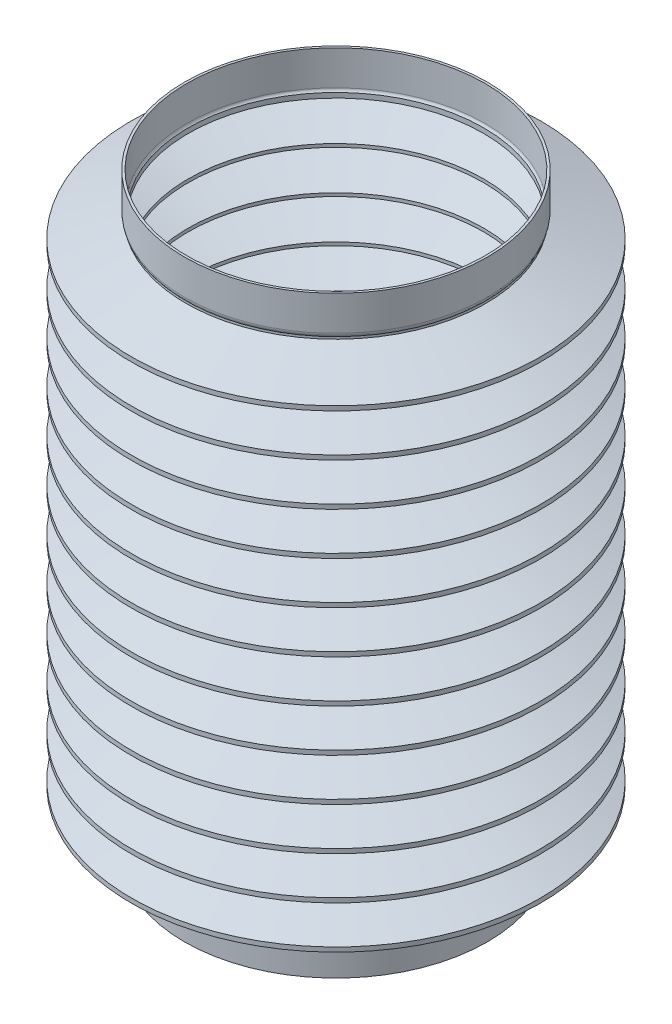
ISO-10303-21;
HEADER;
FILE_DESCRIPTION(('STEP AP214'),'2;1');
FILE_NAME('part.step','',(''),(''),'','','');
FILE_SCHEMA(('AUTOMOTIVE_DESIGN { 1 0 10303 214 1 1 1 1 }'));
ENDSEC;
DATA;
#1=APPLICATION_CONTEXT('core data for automotive mechanical design processes');
#2=APPLICATION_PROTOCOL_DEFINITION('international standard','automotive_design',2000,#1);
#3=PRODUCT_CONTEXT('',#1,'mechanical');
#4=PRODUCT('Part','Part','',(#3));
#5=PRODUCT_RELATED_PRODUCT_CATEGORY('part','',(#4));
#6=PRODUCT_DEFINITION_FORMATION('','',#4);
#7=PRODUCT_DEFINITION_CONTEXT('part definition',#1,'design');
#8=PRODUCT_DEFINITION('design','',#6,#7);
#9=PRODUCT_DEFINITION_SHAPE('','',#8);
#10=(LENGTH_UNIT() NAMED_UNIT(*) SI_UNIT(.MILLI.,.METRE.));
#11=(NAMED_UNIT(*) PLANE_ANGLE_UNIT() SI_UNIT($,.RADIAN.));
#12=(NAMED_UNIT(*) SI_UNIT($,.STERADIAN.) SOLID_ANGLE_UNIT());
#13=UNCERTAINTY_MEASURE_WITH_UNIT(LENGTH_MEASURE(1.E-05),#10,'distance_accuracy_value','');
#14=(GEOMETRIC_REPRESENTATION_CONTEXT(3) GLOBAL_UNCERTAINTY_ASSIGNED_CONTEXT((#13)) GLOBAL_UNIT_ASSIGNED_CONTEXT((#10,
#11,#12)) REPRESENTATION_CONTEXT('',''));
#15=CARTESIAN_POINT('',(0.,0.,0.));
#16=DIRECTION('',(0.,0.,1.));
#17=DIRECTION('',(1.,0.,0.));
#18=AXIS2_PLACEMENT_3D('',#15,#16,#17);
#19=CARTESIAN_POINT('',(0.,158.625,0.));
#20=DIRECTION('',(0.,-1.,0.));
#21=DIRECTION('',(0.,0.,-1.));
#22=AXIS2_PLACEMENT_3D('',#19,#20,#21);
#23=CONICAL_SURFACE('',#22,89.7549423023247,1.23449391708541);
#24=CARTESIAN_POINT('',(0.,167.278882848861,0.));
#25=DIRECTION('',(0.,-1.,0.));
#26=DIRECTION('',(0.,0.,-1.));
#27=AXIS2_PLACEMENT_3D('',#24,#25,#26);
#28=CIRCLE('',#27,65.);
#29=CARTESIAN_POINT('',(0.,167.278882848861,-65.));
#30=VERTEX_POINT('',#29);
#31=EDGE_CURVE('E292',#30,#30,#28,.T.);
#32=ORIENTED_EDGE('',*,*,#31,.F.);
#33=EDGE_LOOP('',(#32));
#34=FACE_BOUND('',#33,.T.);
#35=CARTESIAN_POINT('',(0.,158.625,0.));
#36=DIRECTION('',(0.,-1.,0.));
#37=DIRECTION('',(0.,0.,-1.));
#38=AXIS2_PLACEMENT_3D('',#35,#36,#37);
#39=CIRCLE('',#38,89.7549423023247);
#40=CARTESIAN_POINT('',(0.,158.625,-89.7549423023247));
#41=VERTEX_POINT('',#40);
#42=EDGE_CURVE('E10',#41,#41,#39,.T.);
#43=ORIENTED_EDGE('',*,*,#42,.T.);
#44=EDGE_LOOP('',(#43));
#45=FACE_BOUND('',#44,.T.);
#46=ADVANCED_FACE('F33',(#34,#45),#23,.F.);
#47=CARTESIAN_POINT('',(0.,149.971117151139,0.));
#48=DIRECTION('',(0.,1.,0.));
#49=DIRECTION('',(0.,0.,1.));
#50=AXIS2_PLACEMENT_3D('',#47,#48,#49);
#51=CONICAL_SURFACE('',#50,65.,1.23449391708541);
#52=ORIENTED_EDGE('',*,*,#42,.F.);
#53=EDGE_LOOP('',(#52));
#54=FACE_BOUND('',#53,.T.);
#55=CARTESIAN_POINT('',(0.,149.971117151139,0.));
#56=DIRECTION('',(0.,-1.,0.));
#57=DIRECTION('',(0.,0.,-1.));
#58=AXIS2_PLACEMENT_3D('',#55,#56,#57);
#59=CIRCLE('',#58,65.);
#60=CARTESIAN_POINT('',(0.,149.971117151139,-65.));
#61=VERTEX_POINT('',#60);
#62=EDGE_CURVE('E39',#61,#61,#59,.T.);
#63=ORIENTED_EDGE('',*,*,#62,.T.);
#64=EDGE_LOOP('',(#63));
#65=FACE_BOUND('',#64,.T.);
#66=ADVANCED_FACE('F299',(#54,#65),#51,.F.);
#67=CARTESIAN_POINT('',(0.,0.,0.));
#68=DIRECTION('',(0.,-1.,0.));
#69=DIRECTION('',(0.,0.,-1.));
#70=AXIS2_PLACEMENT_3D('',#67,#68,#69);
#71=CYLINDRICAL_SURFACE('',#70,65.);
#72=ORIENTED_EDGE('',*,*,#62,.F.);
#73=EDGE_LOOP('',(#72));
#74=FACE_BOUND('',#73,.T.);
#75=CARTESIAN_POINT('',(0.,148.528882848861,0.));
#76=DIRECTION('',(0.,-1.,0.));
#77=DIRECTION('',(0.,0.,-1.));
#78=AXIS2_PLACEMENT_3D('',#75,#76,#77);
#79=CIRCLE('',#78,65.);
#80=CARTESIAN_POINT('',(0.,148.528882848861,-65.));
#81=VERTEX_POINT('',#80);
#82=EDGE_CURVE('E43',#81,#81,#79,.T.);
#83=ORIENTED_EDGE('',*,*,#82,.T.);
#84=EDGE_LOOP('',(#83));
#85=FACE_BOUND('',#84,.T.);
#86=ADVANCED_FACE('F303',(#74,#85),#71,.F.);
#87=CARTESIAN_POINT('',(0.,139.875,0.));
#88=DIRECTION('',(0.,-1.,0.));
#89=DIRECTION('',(0.,0.,-1.));
#90=AXIS2_PLACEMENT_3D('',#87,#88,#89);
#91=CONICAL_SURFACE('',#90,89.7549423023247,1.23449391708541);
#92=ORIENTED_EDGE('',*,*,#82,.F.);
#93=EDGE_LOOP('',(#92));
#94=FACE_BOUND('',#93,.T.);
#95=CARTESIAN_POINT('',(0.,139.875,0.));
#96=DIRECTION('',(0.,-1.,0.));
#97=DIRECTION('',(0.,0.,-1.));
#98=AXIS2_PLACEMENT_3D('',#95,#96,#97);
#99=CIRCLE('',#98,89.7549423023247);
#100=CARTESIAN_POINT('',(0.,139.875,-89.7549423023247));
#101=VERTEX_POINT('',#100);
#102=EDGE_CURVE('E47',#101,#101,#99,.T.);
#103=ORIENTED_EDGE('',*,*,#102,.T.);
#104=EDGE_LOOP('',(#103));
#105=FACE_BOUND('',#104,.T.);
#106=ADVANCED_FACE('F308',(#94,#105),#91,.F.);
#107=CARTESIAN_POINT('',(0.,131.221117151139,0.));
#108=DIRECTION('',(0.,1.,0.));
#109=DIRECTION('',(0.,0.,1.));
#110=AXIS2_PLACEMENT_3D('',#107,#108,#109);
#111=CONICAL_SURFACE('',#110,65.,1.23449391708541);
#112=ORIENTED_EDGE('',*,*,#102,.F.);
#113=EDGE_LOOP('',(#112));
#114=FACE_BOUND('',#113,.T.);
#115=CARTESIAN_POINT('',(0.,131.221117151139,0.));
#116=DIRECTION('',(0.,-1.,0.));
#117=DIRECTION('',(0.,0.,-1.));
#118=AXIS2_PLACEMENT_3D('',#115,#116,#117);
#119=CIRCLE('',#118,65.);
#120=CARTESIAN_POINT('',(0.,131.221117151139,-65.));
#121=VERTEX_POINT('',#120);
#122=EDGE_CURVE('E52',#121,#121,#119,.T.);
#123=ORIENTED_EDGE('',*,*,#122,.T.);
#124=EDGE_LOOP('',(#123));
#125=FACE_BOUND('',#124,.T.);
#126=ADVANCED_FACE('F314',(#114,#125),#111,.F.);
#127=CARTESIAN_POINT('',(0.,0.,0.));
#128=DIRECTION('',(0.,-1.,0.));
#129=DIRECTION('',(0.,0.,-1.));
#130=AXIS2_PLACEMENT_3D('',#127,#128,#129);
#131=CYLINDRICAL_SURFACE('',#130,65.);
#132=ORIENTED_EDGE('',*,*,#122,.F.);
#133=EDGE_LOOP('',(#132));
#134=FACE_BOUND('',#133,.T.);
#135=CARTESIAN_POINT('',(0.,129.778882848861,0.));
#136=DIRECTION('',(0.,-1.,0.));
#137=DIRECTION('',(0.,0.,-1.));
#138=AXIS2_PLACEMENT_3D('',#135,#136,#137);
#139=CIRCLE('',#138,65.);
#140=CARTESIAN_POINT('',(0.,129.778882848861,-65.));
#141=VERTEX_POINT('',#140);
#142=EDGE_CURVE('E55',#141,#141,#139,.T.);
#143=ORIENTED_EDGE('',*,*,#142,.T.);
#144=EDGE_LOOP('',(#143));
#145=FACE_BOUND('',#144,.T.);
#146=ADVANCED_FACE('F318',(#134,#145),#131,.F.);
#147=CARTESIAN_POINT('',(0.,121.125,0.));
#148=DIRECTION('',(0.,-1.,0.));
#149=DIRECTION('',(0.,0.,-1.));
#150=AXIS2_PLACEMENT_3D('',#147,#148,#149);
#151=CONICAL_SURFACE('',#150,89.7549423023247,1.23449391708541);
#152=ORIENTED_EDGE('',*,*,#142,.F.);
#153=EDGE_LOOP('',(#152));
#154=FACE_BOUND('',#153,.T.);
#155=CARTESIAN_POINT('',(0.,121.125,0.));
#156=DIRECTION('',(0.,-1.,0.));
#157=DIRECTION('',(0.,0.,-1.));
#158=AXIS2_PLACEMENT_3D('',#155,#156,#157);
#159=CIRCLE('',#158,89.7549423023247);
#160=CARTESIAN_POINT('',(0.,121.125,-89.7549423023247));
#161=VERTEX_POINT('',#160);
#162=EDGE_CURVE('E58',#161,#161,#159,.T.);
#163=ORIENTED_EDGE('',*,*,#162,.T.);
#164=EDGE_LOOP('',(#163));
#165=FACE_BOUND('',#164,.T.);
#166=ADVANCED_FACE('F322',(#154,#165),#151,.F.);
#167=CARTESIAN_POINT('',(0.,112.471117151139,0.));
#168=DIRECTION('',(0.,1.,0.));
#169=DIRECTION('',(0.,0.,1.));
#170=AXIS2_PLACEMENT_3D('',#167,#168,#169);
#171=CONICAL_SURFACE('',#170,65.,1.23449391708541);
#172=ORIENTED_EDGE('',*,*,#162,.F.);
#173=EDGE_LOOP('',(#172));
#174=FACE_BOUND('',#173,.T.);
#175=CARTESIAN_POINT('',(0.,112.471117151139,0.));
#176=DIRECTION('',(0.,-1.,0.));
#177=DIRECTION('',(0.,0.,-1.));
#178=AXIS2_PLACEMENT_3D('',#175,#176,#177);
#179=CIRCLE('',#178,65.);
#180=CARTESIAN_POINT('',(0.,112.471117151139,-65.));
#181=VERTEX_POINT('',#180);
#182=EDGE_CURVE('E61',#181,#181,#179,.T.);
#183=ORIENTED_EDGE('',*,*,#182,.T.);
#184=EDGE_LOOP('',(#183));
#185=FACE_BOUND('',#184,.T.);
#186=ADVANCED_FACE('F326',(#174,#185),#171,.F.);
#187=CARTESIAN_POINT('',(0.,0.,0.));
#188=DIRECTION('',(0.,-1.,0.));
#189=DIRECTION('',(0.,0.,-1.));
#190=AXIS2_PLACEMENT_3D('',#187,#188,#189);
#191=CYLINDRICAL_SURFACE('',#190,65.);
#192=ORIENTED_EDGE('',*,*,#182,.F.);
#193=EDGE_LOOP('',(#192));
#194=FACE_BOUND('',#193,.T.);
#195=CARTESIAN_POINT('',(0.,111.028882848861,0.));
#196=DIRECTION('',(0.,-1.,0.));
#197=DIRECTION('',(0.,0.,-1.));
#198=AXIS2_PLACEMENT_3D('',#195,#196,#197);
#199=CIRCLE('',#198,65.);
#200=CARTESIAN_POINT('',(0.,111.028882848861,-65.));
#201=VERTEX_POINT('',#200);
#202=EDGE_CURVE('E64',#201,#201,#199,.T.);
#203=ORIENTED_EDGE('',*,*,#202,.T.);
#204=EDGE_LOOP('',(#203));
#205=FACE_BOUND('',#204,.T.);
#206=ADVANCED_FACE('F330',(#194,#205),#191,.F.);
#207=CARTESIAN_POINT('',(0.,102.375,0.));
#208=DIRECTION('',(0.,-1.,0.));
#209=DIRECTION('',(0.,0.,-1.));
#210=AXIS2_PLACEMENT_3D('',#207,#208,#209);
#211=CONICAL_SURFACE('',#210,89.7549423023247,1.23449391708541);
#212=ORIENTED_EDGE('',*,*,#202,.F.);
#213=EDGE_LOOP('',(#212));
#214=FACE_BOUND('',#213,.T.);
#215=CARTESIAN_POINT('',(0.,102.375,0.));
#216=DIRECTION('',(0.,-1.,0.));
#217=DIRECTION('',(0.,0.,-1.));
#218=AXIS2_PLACEMENT_3D('',#215,#216,#217);
#219=CIRCLE('',#218,89.7549423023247);
#220=CARTESIAN_POINT('',(0.,102.375,-89.7549423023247));
#221=VERTEX_POINT('',#220);
#222=EDGE_CURVE('E67',#221,#221,#219,.T.);
#223=ORIENTED_EDGE('',*,*,#222,.T.);
#224=EDGE_LOOP('',(#223));
#225=FACE_BOUND('',#224,.T.);
#226=ADVANCED_FACE('F334',(#214,#225),#211,.F.);
#227=CARTESIAN_POINT('',(0.,93.7211171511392,0.));
#228=DIRECTION('',(0.,1.,0.));
#229=DIRECTION('',(0.,0.,1.));
#230=AXIS2_PLACEMENT_3D('',#227,#228,#229);
#231=CONICAL_SURFACE('',#230,65.,1.23449391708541);
#232=ORIENTED_EDGE('',*,*,#222,.F.);
#233=EDGE_LOOP('',(#232));
#234=FACE_BOUND('',#233,.T.);
#235=CARTESIAN_POINT('',(0.,93.7211171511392,0.));
#236=DIRECTION('',(0.,-1.,0.));
#237=DIRECTION('',(0.,0.,-1.));
#238=AXIS2_PLACEMENT_3D('',#235,#236,#237);
#239=CIRCLE('',#238,65.);
#240=CARTESIAN_POINT('',(0.,93.7211171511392,-65.));
#241=VERTEX_POINT('',#240);
#242=EDGE_CURVE('E70',#241,#241,#239,.T.);
#243=ORIENTED_EDGE('',*,*,#242,.T.);
#244=EDGE_LOOP('',(#243));
#245=FACE_BOUND('',#244,.T.);
#246=ADVANCED_FACE('F338',(#234,#245),#231,.F.);
#247=CARTESIAN_POINT('',(0.,0.,0.));
#248=DIRECTION('',(0.,-1.,0.));
#249=DIRECTION('',(0.,0.,-1.));
#250=AXIS2_PLACEMENT_3D('',#247,#248,#249);
#251=CYLINDRICAL_SURFACE('',#250,65.);
#252=ORIENTED_EDGE('',*,*,#242,.F.);
#253=EDGE_LOOP('',(#252));
#254=FACE_BOUND('',#253,.T.);
#255=CARTESIAN_POINT('',(0.,92.2788828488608,0.));
#256=DIRECTION('',(0.,-1.,0.));
#257=DIRECTION('',(0.,0.,-1.));
#258=AXIS2_PLACEMENT_3D('',#255,#256,#257);
#259=CIRCLE('',#258,65.);
#260=CARTESIAN_POINT('',(0.,92.2788828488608,-65.));
#261=VERTEX_POINT('',#260);
#262=EDGE_CURVE('E73',#261,#261,#259,.T.);
#263=ORIENTED_EDGE('',*,*,#262,.T.);
#264=EDGE_LOOP('',(#263));
#265=FACE_BOUND('',#264,.T.);
#266=ADVANCED_FACE('F342',(#254,#265),#251,.F.);
#267=CARTESIAN_POINT('',(0.,83.625,0.));
#268=DIRECTION('',(0.,-1.,0.));
#269=DIRECTION('',(0.,0.,-1.));
#270=AXIS2_PLACEMENT_3D('',#267,#268,#269);
#271=CONICAL_SURFACE('',#270,89.7549423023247,1.23449391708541);
#272=ORIENTED_EDGE('',*,*,#262,.F.);
#273=EDGE_LOOP('',(#272));
#274=FACE_BOUND('',#273,.T.);
#275=CARTESIAN_POINT('',(0.,83.625,0.));
#276=DIRECTION('',(0.,-1.,0.));
#277=DIRECTION('',(0.,0.,-1.));
#278=AXIS2_PLACEMENT_3D('',#275,#276,#277);
#279=CIRCLE('',#278,89.7549423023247);
#280=CARTESIAN_POINT('',(0.,83.625,-89.7549423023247));
#281=VERTEX_POINT('',#280);
#282=EDGE_CURVE('E76',#281,#281,#279,.T.);
#283=ORIENTED_EDGE('',*,*,#282,.T.);
#284=EDGE_LOOP('',(#283));
#285=FACE_BOUND('',#284,.T.);
#286=ADVANCED_FACE('F346',(#274,#285),#271,.F.);
#287=CARTESIAN_POINT('',(0.,74.9711171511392,0.));
#288=DIRECTION('',(0.,1.,0.));
#289=DIRECTION('',(0.,0.,1.));
#290=AXIS2_PLACEMENT_3D('',#287,#288,#289);
#291=CONICAL_SURFACE('',#290,65.,1.23449391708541);
#292=ORIENTED_EDGE('',*,*,#282,.F.);
#293=EDGE_LOOP('',(#292));
#294=FACE_BOUND('',#293,.T.);
#295=CARTESIAN_POINT('',(0.,74.9711171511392,0.));
#296=DIRECTION('',(0.,-1.,0.));
#297=DIRECTION('',(0.,0.,-1.));
#298=AXIS2_PLACEMENT_3D('',#295,#296,#297);
#299=CIRCLE('',#298,65.);
#300=CARTESIAN_POINT('',(0.,74.9711171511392,-65.));
#301=VERTEX_POINT('',#300);
#302=EDGE_CURVE('E79',#301,#301,#299,.T.);
#303=ORIENTED_EDGE('',*,*,#302,.T.);
#304=EDGE_LOOP('',(#303));
#305=FACE_BOUND('',#304,.T.);
#306=ADVANCED_FACE('F350',(#294,#305),#291,.F.);
#307=CARTESIAN_POINT('',(0.,0.,0.));
#308=DIRECTION('',(0.,-1.,0.));
#309=DIRECTION('',(0.,0.,-1.));
#310=AXIS2_PLACEMENT_3D('',#307,#308,#309);
#311=CYLINDRICAL_SURFACE('',#310,65.);
#312=ORIENTED_EDGE('',*,*,#302,.F.);
#313=EDGE_LOOP('',(#312));
#314=FACE_BOUND('',#313,.T.);
#315=CARTESIAN_POINT('',(0.,73.5288828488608,0.));
#316=DIRECTION('',(0.,-1.,0.));
#317=DIRECTION('',(0.,0.,-1.));
#318=AXIS2_PLACEMENT_3D('',#315,#316,#317);
#319=CIRCLE('',#318,65.);
#320=CARTESIAN_POINT('',(0.,73.5288828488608,-65.));
#321=VERTEX_POINT('',#320);
#322=EDGE_CURVE('E82',#321,#321,#319,.T.);
#323=ORIENTED_EDGE('',*,*,#322,.T.);
#324=EDGE_LOOP('',(#323));
#325=FACE_BOUND('',#324,.T.);
#326=ADVANCED_FACE('F354',(#314,#325),#311,.F.);
#327=CARTESIAN_POINT('',(0.,64.875,0.));
#328=DIRECTION('',(0.,-1.,0.));
#329=DIRECTION('',(0.,0.,-1.));
#330=AXIS2_PLACEMENT_3D('',#327,#328,#329);
#331=CONICAL_SURFACE('',#330,89.7549423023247,1.23449391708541);
#332=ORIENTED_EDGE('',*,*,#322,.F.);
#333=EDGE_LOOP('',(#332));
#334=FACE_BOUND('',#333,.T.);
#335=CARTESIAN_POINT('',(0.,64.875,0.));
#336=DIRECTION('',(0.,-1.,0.));
#337=DIRECTION('',(0.,0.,-1.));
#338=AXIS2_PLACEMENT_3D('',#335,#336,#337);
#339=CIRCLE('',#338,89.7549423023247);
#340=CARTESIAN_POINT('',(0.,64.875,-89.7549423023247));
#341=VERTEX_POINT('',#340);
#342=EDGE_CURVE('E85',#341,#341,#339,.T.);
#343=ORIENTED_EDGE('',*,*,#342,.T.);
#344=EDGE_LOOP('',(#343));
#345=FACE_BOUND('',#344,.T.);
#346=ADVANCED_FACE('F358',(#334,#345),#331,.F.);
#347=CARTESIAN_POINT('',(0.,56.2211171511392,0.));
#348=DIRECTION('',(0.,1.,0.));
#349=DIRECTION('',(0.,0.,1.));
#350=AXIS2_PLACEMENT_3D('',#347,#348,#349);
#351=CONICAL_SURFACE('',#350,65.,1.23449391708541);
#352=ORIENTED_EDGE('',*,*,#342,.F.);
#353=EDGE_LOOP('',(#352));
#354=FACE_BOUND('',#353,.T.);
#355=CARTESIAN_POINT('',(0.,56.2211171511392,0.));
#356=DIRECTION('',(0.,-1.,0.));
#357=DIRECTION('',(0.,0.,-1.));
#358=AXIS2_PLACEMENT_3D('',#355,#356,#357);
#359=CIRCLE('',#358,65.);
#360=CARTESIAN_POINT('',(0.,56.2211171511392,-65.));
#361=VERTEX_POINT('',#360);
#362=EDGE_CURVE('E88',#361,#361,#359,.T.);
#363=ORIENTED_EDGE('',*,*,#362,.T.);
#364=EDGE_LOOP('',(#363));
#365=FACE_BOUND('',#364,.T.);
#366=ADVANCED_FACE('F362',(#354,#365),#351,.F.);
#367=CARTESIAN_POINT('',(0.,0.,0.));
#368=DIRECTION('',(0.,-1.,0.));
#369=DIRECTION('',(0.,0.,-1.));
#370=AXIS2_PLACEMENT_3D('',#367,#368,#369);
#371=CYLINDRICAL_SURFACE('',#370,65.);
#372=ORIENTED_EDGE('',*,*,#362,.F.);
#373=EDGE_LOOP('',(#372));
#374=FACE_BOUND('',#373,.T.);
#375=CARTESIAN_POINT('',(0.,54.7788828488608,0.));
#376=DIRECTION('',(0.,-1.,0.));
#377=DIRECTION('',(0.,0.,-1.));
#378=AXIS2_PLACEMENT_3D('',#375,#376,#377);
#379=CIRCLE('',#378,65.);
#380=CARTESIAN_POINT('',(0.,54.7788828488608,-65.));
#381=VERTEX_POINT('',#380);
#382=EDGE_CURVE('E91',#381,#381,#379,.T.);
#383=ORIENTED_EDGE('',*,*,#382,.T.);
#384=EDGE_LOOP('',(#383));
#385=FACE_BOUND('',#384,.T.);
#386=ADVANCED_FACE('F366',(#374,#385),#371,.F.);
#387=CARTESIAN_POINT('',(0.,46.125,0.));
#388=DIRECTION('',(0.,-1.,0.));
#389=DIRECTION('',(0.,0.,-1.));
#390=AXIS2_PLACEMENT_3D('',#387,#388,#389);
#391=CONICAL_SURFACE('',#390,89.7549423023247,1.23449391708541);
#392=ORIENTED_EDGE('',*,*,#382,.F.);
#393=EDGE_LOOP('',(#392));
#394=FACE_BOUND('',#393,.T.);
#395=CARTESIAN_POINT('',(0.,46.125,0.));
#396=DIRECTION('',(0.,-1.,0.));
#397=DIRECTION('',(0.,0.,-1.));
#398=AXIS2_PLACEMENT_3D('',#395,#396,#397);
#399=CIRCLE('',#398,89.7549423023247);
#400=CARTESIAN_POINT('',(0.,46.125,-89.7549423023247));
#401=VERTEX_POINT('',#400);
#402=EDGE_CURVE('E94',#401,#401,#399,.T.);
#403=ORIENTED_EDGE('',*,*,#402,.T.);
#404=EDGE_LOOP('',(#403));
#405=FACE_BOUND('',#404,.T.);
#406=ADVANCED_FACE('F370',(#394,#405),#391,.F.);
#407=CARTESIAN_POINT('',(0.,37.4711171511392,0.));
#408=DIRECTION('',(0.,1.,0.));
#409=DIRECTION('',(0.,0.,1.));
#410=AXIS2_PLACEMENT_3D('',#407,#408,#409);
#411=CONICAL_SURFACE('',#410,65.,1.23449391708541);
#412=ORIENTED_EDGE('',*,*,#402,.F.);
#413=EDGE_LOOP('',(#412));
#414=FACE_BOUND('',#413,.T.);
#415=CARTESIAN_POINT('',(0.,37.4711171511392,0.));
#416=DIRECTION('',(0.,-1.,0.));
#417=DIRECTION('',(0.,0.,-1.));
#418=AXIS2_PLACEMENT_3D('',#415,#416,#417);
#419=CIRCLE('',#418,65.);
#420=CARTESIAN_POINT('',(0.,37.4711171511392,-65.));
#421=VERTEX_POINT('',#420);
#422=EDGE_CURVE('E97',#421,#421,#419,.T.);
#423=ORIENTED_EDGE('',*,*,#422,.T.);
#424=EDGE_LOOP('',(#423));
#425=FACE_BOUND('',#424,.T.);
#426=ADVANCED_FACE('F374',(#414,#425),#411,.F.);
#427=CARTESIAN_POINT('',(0.,0.,0.));
#428=DIRECTION('',(0.,-1.,0.));
#429=DIRECTION('',(0.,0.,-1.));
#430=AXIS2_PLACEMENT_3D('',#427,#428,#429);
#431=CYLINDRICAL_SURFACE('',#430,65.);
#432=ORIENTED_EDGE('',*,*,#422,.F.);
#433=EDGE_LOOP('',(#432));
#434=FACE_BOUND('',#433,.T.);
#435=CARTESIAN_POINT('',(0.,36.0288828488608,0.));
#436=DIRECTION('',(0.,-1.,0.));
#437=DIRECTION('',(0.,0.,-1.));
#438=AXIS2_PLACEMENT_3D('',#435,#436,#437);
#439=CIRCLE('',#438,65.);
#440=CARTESIAN_POINT('',(0.,36.0288828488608,-65.));
#441=VERTEX_POINT('',#440);
#442=EDGE_CURVE('E100',#441,#441,#439,.T.);
#443=ORIENTED_EDGE('',*,*,#442,.T.);
#444=EDGE_LOOP('',(#443));
#445=FACE_BOUND('',#444,.T.);
#446=ADVANCED_FACE('F378',(#434,#445),#431,.F.);
#447=CARTESIAN_POINT('',(0.,27.375,0.));
#448=DIRECTION('',(0.,-1.,0.));
#449=DIRECTION('',(0.,0.,-1.));
#450=AXIS2_PLACEMENT_3D('',#447,#448,#449);
#451=CONICAL_SURFACE('',#450,89.7549423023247,1.23449391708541);
#452=ORIENTED_EDGE('',*,*,#442,.F.);
#453=EDGE_LOOP('',(#452));
#454=FACE_BOUND('',#453,.T.);
#455=CARTESIAN_POINT('',(0.,27.375,0.));
#456=DIRECTION('',(0.,-1.,0.));
#457=DIRECTION('',(0.,0.,-1.));
#458=AXIS2_PLACEMENT_3D('',#455,#456,#457);
#459=CIRCLE('',#458,89.7549423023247);
#460=CARTESIAN_POINT('',(0.,27.375,-89.7549423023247));
#461=VERTEX_POINT('',#460);
#462=EDGE_CURVE('E103',#461,#461,#459,.T.);
#463=ORIENTED_EDGE('',*,*,#462,.T.);
#464=EDGE_LOOP('',(#463));
#465=FACE_BOUND('',#464,.T.);
#466=ADVANCED_FACE('F382',(#454,#465),#451,.F.);
#467=CARTESIAN_POINT('',(0.,18.7211171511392,0.));
#468=DIRECTION('',(0.,1.,0.));
#469=DIRECTION('',(0.,0.,1.));
#470=AXIS2_PLACEMENT_3D('',#467,#468,#469);
#471=CONICAL_SURFACE('',#470,65.,1.23449391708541);
#472=ORIENTED_EDGE('',*,*,#462,.F.);
#473=EDGE_LOOP('',(#472));
#474=FACE_BOUND('',#473,.T.);
#475=CARTESIAN_POINT('',(0.,18.7211171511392,0.));
#476=DIRECTION('',(0.,-1.,0.));
#477=DIRECTION('',(0.,0.,-1.));
#478=AXIS2_PLACEMENT_3D('',#475,#476,#477);
#479=CIRCLE('',#478,65.);
#480=CARTESIAN_POINT('',(0.,18.7211171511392,-65.));
#481=VERTEX_POINT('',#480);
#482=EDGE_CURVE('E106',#481,#481,#479,.T.);
#483=ORIENTED_EDGE('',*,*,#482,.T.);
#484=EDGE_LOOP('',(#483));
#485=FACE_BOUND('',#484,.T.);
#486=ADVANCED_FACE('F386',(#474,#485),#471,.F.);
#487=CARTESIAN_POINT('',(0.,0.,0.));
#488=DIRECTION('',(0.,-1.,0.));
#489=DIRECTION('',(0.,0.,-1.));
#490=AXIS2_PLACEMENT_3D('',#487,#488,#489);
#491=CYLINDRICAL_SURFACE('',#490,65.);
#492=ORIENTED_EDGE('',*,*,#482,.F.);
#493=EDGE_LOOP('',(#492));
#494=FACE_BOUND('',#493,.T.);
#495=CARTESIAN_POINT('',(0.,16.1374218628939,0.));
#496=DIRECTION('',(0.,-1.,0.));
#497=DIRECTION('',(0.,0.,-1.));
#498=AXIS2_PLACEMENT_3D('',#495,#496,#497);
#499=CIRCLE('',#498,65.);
#500=CARTESIAN_POINT('',(0.,16.1374218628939,-65.));
#501=VERTEX_POINT('',#500);
#502=EDGE_CURVE('E109',#501,#501,#499,.T.);
#503=ORIENTED_EDGE('',*,*,#502,.T.);
#504=EDGE_LOOP('',(#503));
#505=FACE_BOUND('',#504,.T.);
#506=ADVANCED_FACE('F390',(#494,#505),#491,.F.);
#507=CARTESIAN_POINT('',(0.,14.8497712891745,0.));
#508=DIRECTION('',(0.,-1.,0.));
#509=DIRECTION('',(0.,0.,-1.));
#510=AXIS2_PLACEMENT_3D('',#507,#508,#509);
#511=TOROIDAL_SURFACE('',#510,64.0714999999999,1.58750000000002);
#512=ORIENTED_EDGE('',*,*,#502,.F.);
#513=EDGE_LOOP('',(#512));
#514=FACE_BOUND('',#513,.T.);
#515=CARTESIAN_POINT('',(0.,14.8497712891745,0.));
#516=DIRECTION('',(0.,-1.,0.));
#517=DIRECTION('',(0.,0.,-1.));
#518=AXIS2_PLACEMENT_3D('',#515,#516,#517);
#519=CIRCLE('',#518,65.659);
#520=CARTESIAN_POINT('',(0.,14.8497712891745,-65.659));
#521=VERTEX_POINT('',#520);
#522=EDGE_CURVE('E112',#521,#521,#519,.T.);
#523=ORIENTED_EDGE('',*,*,#522,.T.);
#524=EDGE_LOOP('',(#523));
#525=FACE_BOUND('',#524,.T.);
#526=ADVANCED_FACE('F394',(#514,#525),#511,.F.);
#527=CARTESIAN_POINT('',(0.,0.,0.));
#528=DIRECTION('',(0.,-1.,0.));
#529=DIRECTION('',(0.,0.,-1.));
#530=AXIS2_PLACEMENT_3D('',#527,#528,#529);
#531=CYLINDRICAL_SURFACE('',#530,65.659);
#532=ORIENTED_EDGE('',*,*,#522,.F.);
#533=EDGE_LOOP('',(#532));
#534=FACE_BOUND('',#533,.T.);
#535=CARTESIAN_POINT('',(0.,0.,0.));
#536=DIRECTION('',(0.,-1.,0.));
#537=DIRECTION('',(0.,0.,-1.));
#538=AXIS2_PLACEMENT_3D('',#535,#536,#537);
#539=CIRCLE('',#538,65.659);
#540=CARTESIAN_POINT('',(0.,0.,-65.659));
#541=VERTEX_POINT('',#540);
#542=EDGE_CURVE('E115',#541,#541,#539,.T.);
#543=ORIENTED_EDGE('',*,*,#542,.T.);
#544=EDGE_LOOP('',(#543));
#545=FACE_BOUND('',#544,.T.);
#546=ADVANCED_FACE('F398',(#534,#545),#531,.F.);
#547=CARTESIAN_POINT('',(-66.675,0.,0.));
#548=DIRECTION('',(0.,1.,0.));
#549=DIRECTION('',(0.,0.,1.));
#550=AXIS2_PLACEMENT_3D('',#547,#548,#549);
#551=PLANE('',#550);
#552=ORIENTED_EDGE('',*,*,#542,.F.);
#553=EDGE_LOOP('',(#552));
#554=FACE_BOUND('',#553,.T.);
#555=CARTESIAN_POINT('',(0.,0.,0.));
#556=DIRECTION('',(0.,-1.,0.));
#557=DIRECTION('',(0.,0.,-1.));
#558=AXIS2_PLACEMENT_3D('',#555,#556,#557);
#559=CIRCLE('',#558,66.675);
#560=CARTESIAN_POINT('',(0.,0.,-66.675));
#561=VERTEX_POINT('',#560);
#562=EDGE_CURVE('E118',#561,#561,#559,.T.);
#563=ORIENTED_EDGE('',*,*,#562,.T.);
#564=EDGE_LOOP('',(#563));
#565=FACE_BOUND('',#564,.T.);
#566=ADVANCED_FACE('F402',(#554,#565),#551,.F.);
#567=CARTESIAN_POINT('',(0.,0.,0.));
#568=DIRECTION('',(0.,-1.,0.));
#569=DIRECTION('',(0.,0.,-1.));
#570=AXIS2_PLACEMENT_3D('',#567,#568,#569);
#571=CYLINDRICAL_SURFACE('',#570,66.675);
#572=ORIENTED_EDGE('',*,*,#562,.F.);
#573=EDGE_LOOP('',(#572));
#574=FACE_BOUND('',#573,.T.);
#575=CARTESIAN_POINT('',(0.,14.8497712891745,0.));
#576=DIRECTION('',(0.,-1.,0.));
#577=DIRECTION('',(0.,0.,-1.));
#578=AXIS2_PLACEMENT_3D('',#575,#576,#577);
#579=CIRCLE('',#578,66.675);
#580=CARTESIAN_POINT('',(0.,14.8497712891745,-66.675));
#581=VERTEX_POINT('',#580);
#582=EDGE_CURVE('E121',#581,#581,#579,.T.);
#583=ORIENTED_EDGE('',*,*,#582,.T.);
#584=EDGE_LOOP('',(#583));
#585=FACE_BOUND('',#584,.T.);
#586=ADVANCED_FACE('F406',(#574,#585),#571,.T.);
#587=CARTESIAN_POINT('',(0.,14.8497712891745,0.));
#588=DIRECTION('',(0.,-1.,0.));
#589=DIRECTION('',(0.,0.,-1.));
#590=AXIS2_PLACEMENT_3D('',#587,#588,#589);
#591=TOROIDAL_SURFACE('',#590,64.0714999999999,2.60350000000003);
#592=ORIENTED_EDGE('',*,*,#582,.F.);
#593=EDGE_LOOP('',(#592));
#594=FACE_BOUND('',#593,.T.);
#595=CARTESIAN_POINT('',(0.,16.5809939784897,0.));
#596=DIRECTION('',(0.,-1.,0.));
#597=DIRECTION('',(0.,0.,-1.));
#598=AXIS2_PLACEMENT_3D('',#595,#596,#597);
#599=CIRCLE('',#598,66.016);
#600=CARTESIAN_POINT('',(0.,16.5809939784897,-66.016));
#601=VERTEX_POINT('',#600);
#602=EDGE_CURVE('E124',#601,#601,#599,.T.);
#603=ORIENTED_EDGE('',*,*,#602,.T.);
#604=EDGE_LOOP('',(#603));
#605=FACE_BOUND('',#604,.T.);
#606=ADVANCED_FACE('F410',(#594,#605),#591,.T.);
#607=CARTESIAN_POINT('',(0.,0.,0.));
#608=DIRECTION('',(0.,-1.,0.));
#609=DIRECTION('',(0.,0.,-1.));
#610=AXIS2_PLACEMENT_3D('',#607,#608,#609);
#611=CYLINDRICAL_SURFACE('',#610,66.016);
#612=ORIENTED_EDGE('',*,*,#602,.F.);
#613=EDGE_LOOP('',(#612));
#614=FACE_BOUND('',#613,.T.);
#615=CARTESIAN_POINT('',(0.,18.,0.));
#616=DIRECTION('',(0.,-1.,0.));
#617=DIRECTION('',(0.,0.,-1.));
#618=AXIS2_PLACEMENT_3D('',#615,#616,#617);
#619=CIRCLE('',#618,66.016);
#620=CARTESIAN_POINT('',(0.,18.,-66.016));
#621=VERTEX_POINT('',#620);
#622=EDGE_CURVE('E127',#621,#621,#619,.T.);
#623=ORIENTED_EDGE('',*,*,#622,.T.);
#624=EDGE_LOOP('',(#623));
#625=FACE_BOUND('',#624,.T.);
#626=ADVANCED_FACE('F414',(#614,#625),#611,.T.);
#627=CARTESIAN_POINT('',(0.,26.3843752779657,0.));
#628=DIRECTION('',(0.,1.,0.));
#629=DIRECTION('',(0.,0.,1.));
#630=AXIS2_PLACEMENT_3D('',#627,#628,#629);
#631=CONICAL_SURFACE('',#630,90.,1.23449391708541);
#632=ORIENTED_EDGE('',*,*,#622,.F.);
#633=EDGE_LOOP('',(#632));
#634=FACE_BOUND('',#633,.T.);
#635=CARTESIAN_POINT('',(0.,26.3843752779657,0.));
#636=DIRECTION('',(0.,-1.,0.));
#637=DIRECTION('',(0.,0.,-1.));
#638=AXIS2_PLACEMENT_3D('',#635,#636,#637);
#639=CIRCLE('',#638,90.);
#640=CARTESIAN_POINT('',(0.,26.3843752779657,-90.));
#641=VERTEX_POINT('',#640);
#642=EDGE_CURVE('E130',#641,#641,#639,.T.);
#643=ORIENTED_EDGE('',*,*,#642,.T.);
#644=EDGE_LOOP('',(#643));
#645=FACE_BOUND('',#644,.T.);
#646=ADVANCED_FACE('F418',(#634,#645),#631,.T.);
#647=CARTESIAN_POINT('',(0.,0.,0.));
#648=DIRECTION('',(0.,-1.,0.));
#649=DIRECTION('',(0.,0.,-1.));
#650=AXIS2_PLACEMENT_3D('',#647,#648,#649);
#651=CYLINDRICAL_SURFACE('',#650,90.);
#652=ORIENTED_EDGE('',*,*,#642,.F.);
#653=EDGE_LOOP('',(#652));
#654=FACE_BOUND('',#653,.T.);
#655=CARTESIAN_POINT('',(0.,28.3656247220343,0.));
#656=DIRECTION('',(0.,-1.,0.));
#657=DIRECTION('',(0.,0.,-1.));
#658=AXIS2_PLACEMENT_3D('',#655,#656,#657);
#659=CIRCLE('',#658,90.);
#660=CARTESIAN_POINT('',(0.,28.3656247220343,-90.));
#661=VERTEX_POINT('',#660);
#662=EDGE_CURVE('E133',#661,#661,#659,.T.);
#663=ORIENTED_EDGE('',*,*,#662,.T.);
#664=EDGE_LOOP('',(#663));
#665=FACE_BOUND('',#664,.T.);
#666=ADVANCED_FACE('F422',(#654,#665),#651,.T.);
#667=CARTESIAN_POINT('',(0.,36.75,0.));
#668=DIRECTION('',(0.,-1.,0.));
#669=DIRECTION('',(0.,0.,-1.));
#670=AXIS2_PLACEMENT_3D('',#667,#668,#669);
#671=CONICAL_SURFACE('',#670,66.016,1.23449391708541);
#672=ORIENTED_EDGE('',*,*,#662,.F.);
#673=EDGE_LOOP('',(#672));
#674=FACE_BOUND('',#673,.T.);
#675=CARTESIAN_POINT('',(0.,36.75,0.));
#676=DIRECTION('',(0.,-1.,0.));
#677=DIRECTION('',(0.,0.,-1.));
#678=AXIS2_PLACEMENT_3D('',#675,#676,#677);
#679=CIRCLE('',#678,66.016);
#680=CARTESIAN_POINT('',(0.,36.75,-66.016));
#681=VERTEX_POINT('',#680);
#682=EDGE_CURVE('E136',#681,#681,#679,.T.);
#683=ORIENTED_EDGE('',*,*,#682,.T.);
#684=EDGE_LOOP('',(#683));
#685=FACE_BOUND('',#684,.T.);
#686=ADVANCED_FACE('F426',(#674,#685),#671,.T.);
#687=CARTESIAN_POINT('',(0.,45.1343752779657,0.));
#688=DIRECTION('',(0.,1.,0.));
#689=DIRECTION('',(0.,0.,1.));
#690=AXIS2_PLACEMENT_3D('',#687,#688,#689);
#691=CONICAL_SURFACE('',#690,90.,1.23449391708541);
#692=ORIENTED_EDGE('',*,*,#682,.F.);
#693=EDGE_LOOP('',(#692));
#694=FACE_BOUND('',#693,.T.);
#695=CARTESIAN_POINT('',(0.,45.1343752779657,0.));
#696=DIRECTION('',(0.,-1.,0.));
#697=DIRECTION('',(0.,0.,-1.));
#698=AXIS2_PLACEMENT_3D('',#695,#696,#697);
#699=CIRCLE('',#698,90.);
#700=CARTESIAN_POINT('',(0.,45.1343752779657,-90.));
#701=VERTEX_POINT('',#700);
#702=EDGE_CURVE('E139',#701,#701,#699,.T.);
#703=ORIENTED_EDGE('',*,*,#702,.T.);
#704=EDGE_LOOP('',(#703));
#705=FACE_BOUND('',#704,.T.);
#706=ADVANCED_FACE('F430',(#694,#705),#691,.T.);
#707=CARTESIAN_POINT('',(0.,0.,0.));
#708=DIRECTION('',(0.,-1.,0.));
#709=DIRECTION('',(0.,0.,-1.));
#710=AXIS2_PLACEMENT_3D('',#707,#708,#709);
#711=CYLINDRICAL_SURFACE('',#710,90.);
#712=ORIENTED_EDGE('',*,*,#702,.F.);
#713=EDGE_LOOP('',(#712));
#714=FACE_BOUND('',#713,.T.);
#715=CARTESIAN_POINT('',(0.,47.1156247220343,0.));
#716=DIRECTION('',(0.,-1.,0.));
#717=DIRECTION('',(0.,0.,-1.));
#718=AXIS2_PLACEMENT_3D('',#715,#716,#717);
#719=CIRCLE('',#718,90.);
#720=CARTESIAN_POINT('',(0.,47.1156247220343,-90.));
#721=VERTEX_POINT('',#720);
#722=EDGE_CURVE('E142',#721,#721,#719,.T.);
#723=ORIENTED_EDGE('',*,*,#722,.T.);
#724=EDGE_LOOP('',(#723));
#725=FACE_BOUND('',#724,.T.);
#726=ADVANCED_FACE('F434',(#714,#725),#711,.T.);
#727=CARTESIAN_POINT('',(0.,55.5,0.));
#728=DIRECTION('',(0.,-1.,0.));
#729=DIRECTION('',(0.,0.,-1.));
#730=AXIS2_PLACEMENT_3D('',#727,#728,#729);
#731=CONICAL_SURFACE('',#730,66.016,1.23449391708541);
#732=ORIENTED_EDGE('',*,*,#722,.F.);
#733=EDGE_LOOP('',(#732));
#734=FACE_BOUND('',#733,.T.);
#735=CARTESIAN_POINT('',(0.,55.5,0.));
#736=DIRECTION('',(0.,-1.,0.));
#737=DIRECTION('',(0.,0.,-1.));
#738=AXIS2_PLACEMENT_3D('',#735,#736,#737);
#739=CIRCLE('',#738,66.016);
#740=CARTESIAN_POINT('',(0.,55.5,-66.016));
#741=VERTEX_POINT('',#740);
#742=EDGE_CURVE('E145',#741,#741,#739,.T.);
#743=ORIENTED_EDGE('',*,*,#742,.T.);
#744=EDGE_LOOP('',(#743));
#745=FACE_BOUND('',#744,.T.);
#746=ADVANCED_FACE('F438',(#734,#745),#731,.T.);
#747=CARTESIAN_POINT('',(0.,63.8843752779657,0.));
#748=DIRECTION('',(0.,1.,0.));
#749=DIRECTION('',(0.,0.,1.));
#750=AXIS2_PLACEMENT_3D('',#747,#748,#749);
#751=CONICAL_SURFACE('',#750,90.,1.23449391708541);
#752=ORIENTED_EDGE('',*,*,#742,.F.);
#753=EDGE_LOOP('',(#752));
#754=FACE_BOUND('',#753,.T.);
#755=CARTESIAN_POINT('',(0.,63.8843752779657,0.));
#756=DIRECTION('',(0.,-1.,0.));
#757=DIRECTION('',(0.,0.,-1.));
#758=AXIS2_PLACEMENT_3D('',#755,#756,#757);
#759=CIRCLE('',#758,90.);
#760=CARTESIAN_POINT('',(0.,63.8843752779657,-90.));
#761=VERTEX_POINT('',#760);
#762=EDGE_CURVE('E148',#761,#761,#759,.T.);
#763=ORIENTED_EDGE('',*,*,#762,.T.);
#764=EDGE_LOOP('',(#763));
#765=FACE_BOUND('',#764,.T.);
#766=ADVANCED_FACE('F442',(#754,#765),#751,.T.);
#767=CARTESIAN_POINT('',(0.,0.,0.));
#768=DIRECTION('',(0.,-1.,0.));
#769=DIRECTION('',(0.,0.,-1.));
#770=AXIS2_PLACEMENT_3D('',#767,#768,#769);
#771=CYLINDRICAL_SURFACE('',#770,90.);
#772=ORIENTED_EDGE('',*,*,#762,.F.);
#773=EDGE_LOOP('',(#772));
#774=FACE_BOUND('',#773,.T.);
#775=CARTESIAN_POINT('',(0.,65.8656247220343,0.));
#776=DIRECTION('',(0.,-1.,0.));
#777=DIRECTION('',(0.,0.,-1.));
#778=AXIS2_PLACEMENT_3D('',#775,#776,#777);
#779=CIRCLE('',#778,90.);
#780=CARTESIAN_POINT('',(0.,65.8656247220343,-90.));
#781=VERTEX_POINT('',#780);
#782=EDGE_CURVE('E151',#781,#781,#779,.T.);
#783=ORIENTED_EDGE('',*,*,#782,.T.);
#784=EDGE_LOOP('',(#783));
#785=FACE_BOUND('',#784,.T.);
#786=ADVANCED_FACE('F446',(#774,#785),#771,.T.);
#787=CARTESIAN_POINT('',(0.,74.25,0.));
#788=DIRECTION('',(0.,-1.,0.));
#789=DIRECTION('',(0.,0.,-1.));
#790=AXIS2_PLACEMENT_3D('',#787,#788,#789);
#791=CONICAL_SURFACE('',#790,66.016,1.23449391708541);
#792=ORIENTED_EDGE('',*,*,#782,.F.);
#793=EDGE_LOOP('',(#792));
#794=FACE_BOUND('',#793,.T.);
#795=CARTESIAN_POINT('',(0.,74.25,0.));
#796=DIRECTION('',(0.,-1.,0.));
#797=DIRECTION('',(0.,0.,-1.));
#798=AXIS2_PLACEMENT_3D('',#795,#796,#797);
#799=CIRCLE('',#798,66.016);
#800=CARTESIAN_POINT('',(0.,74.25,-66.016));
#801=VERTEX_POINT('',#800);
#802=EDGE_CURVE('E154',#801,#801,#799,.T.);
#803=ORIENTED_EDGE('',*,*,#802,.T.);
#804=EDGE_LOOP('',(#803));
#805=FACE_BOUND('',#804,.T.);
#806=ADVANCED_FACE('F450',(#794,#805),#791,.T.);
#807=CARTESIAN_POINT('',(0.,82.6343752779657,0.));
#808=DIRECTION('',(0.,1.,0.));
#809=DIRECTION('',(0.,0.,1.));
#810=AXIS2_PLACEMENT_3D('',#807,#808,#809);
#811=CONICAL_SURFACE('',#810,90.,1.23449391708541);
#812=ORIENTED_EDGE('',*,*,#802,.F.);
#813=EDGE_LOOP('',(#812));
#814=FACE_BOUND('',#813,.T.);
#815=CARTESIAN_POINT('',(0.,82.6343752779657,0.));
#816=DIRECTION('',(0.,-1.,0.));
#817=DIRECTION('',(0.,0.,-1.));
#818=AXIS2_PLACEMENT_3D('',#815,#816,#817);
#819=CIRCLE('',#818,90.);
#820=CARTESIAN_POINT('',(0.,82.6343752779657,-90.));
#821=VERTEX_POINT('',#820);
#822=EDGE_CURVE('E157',#821,#821,#819,.T.);
#823=ORIENTED_EDGE('',*,*,#822,.T.);
#824=EDGE_LOOP('',(#823));
#825=FACE_BOUND('',#824,.T.);
#826=ADVANCED_FACE('F454',(#814,#825),#811,.T.);
#827=CARTESIAN_POINT('',(0.,0.,0.));
#828=DIRECTION('',(0.,-1.,0.));
#829=DIRECTION('',(0.,0.,-1.));
#830=AXIS2_PLACEMENT_3D('',#827,#828,#829);
#831=CYLINDRICAL_SURFACE('',#830,90.);
#832=ORIENTED_EDGE('',*,*,#822,.F.);
#833=EDGE_LOOP('',(#832));
#834=FACE_BOUND('',#833,.T.);
#835=CARTESIAN_POINT('',(0.,84.6156247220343,0.));
#836=DIRECTION('',(0.,-1.,0.));
#837=DIRECTION('',(0.,0.,-1.));
#838=AXIS2_PLACEMENT_3D('',#835,#836,#837);
#839=CIRCLE('',#838,90.);
#840=CARTESIAN_POINT('',(0.,84.6156247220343,-90.));
#841=VERTEX_POINT('',#840);
#842=EDGE_CURVE('E160',#841,#841,#839,.T.);
#843=ORIENTED_EDGE('',*,*,#842,.T.);
#844=EDGE_LOOP('',(#843));
#845=FACE_BOUND('',#844,.T.);
#846=ADVANCED_FACE('F458',(#834,#845),#831,.T.);
#847=CARTESIAN_POINT('',(0.,93.,0.));
#848=DIRECTION('',(0.,-1.,0.));
#849=DIRECTION('',(0.,0.,-1.));
#850=AXIS2_PLACEMENT_3D('',#847,#848,#849);
#851=CONICAL_SURFACE('',#850,66.016,1.23449391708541);
#852=ORIENTED_EDGE('',*,*,#842,.F.);
#853=EDGE_LOOP('',(#852));
#854=FACE_BOUND('',#853,.T.);
#855=CARTESIAN_POINT('',(0.,93.,0.));
#856=DIRECTION('',(0.,-1.,0.));
#857=DIRECTION('',(0.,0.,-1.));
#858=AXIS2_PLACEMENT_3D('',#855,#856,#857);
#859=CIRCLE('',#858,66.016);
#860=CARTESIAN_POINT('',(0.,93.,-66.016));
#861=VERTEX_POINT('',#860);
#862=EDGE_CURVE('E163',#861,#861,#859,.T.);
#863=ORIENTED_EDGE('',*,*,#862,.T.);
#864=EDGE_LOOP('',(#863));
#865=FACE_BOUND('',#864,.T.);
#866=ADVANCED_FACE('F462',(#854,#865),#851,.T.);
#867=CARTESIAN_POINT('',(0.,101.384375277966,0.));
#868=DIRECTION('',(0.,1.,0.));
#869=DIRECTION('',(0.,0.,1.));
#870=AXIS2_PLACEMENT_3D('',#867,#868,#869);
#871=CONICAL_SURFACE('',#870,90.,1.23449391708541);
#872=ORIENTED_EDGE('',*,*,#862,.F.);
#873=EDGE_LOOP('',(#872));
#874=FACE_BOUND('',#873,.T.);
#875=CARTESIAN_POINT('',(0.,101.384375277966,0.));
#876=DIRECTION('',(0.,-1.,0.));
#877=DIRECTION('',(0.,0.,-1.));
#878=AXIS2_PLACEMENT_3D('',#875,#876,#877);
#879=CIRCLE('',#878,90.);
#880=CARTESIAN_POINT('',(0.,101.384375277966,-90.));
#881=VERTEX_POINT('',#880);
#882=EDGE_CURVE('E166',#881,#881,#879,.T.);
#883=ORIENTED_EDGE('',*,*,#882,.T.);
#884=EDGE_LOOP('',(#883));
#885=FACE_BOUND('',#884,.T.);
#886=ADVANCED_FACE('F466',(#874,#885),#871,.T.);
#887=CARTESIAN_POINT('',(0.,0.,0.));
#888=DIRECTION('',(0.,-1.,0.));
#889=DIRECTION('',(0.,0.,-1.));
#890=AXIS2_PLACEMENT_3D('',#887,#888,#889);
#891=CYLINDRICAL_SURFACE('',#890,90.);
#892=ORIENTED_EDGE('',*,*,#882,.F.);
#893=EDGE_LOOP('',(#892));
#894=FACE_BOUND('',#893,.T.);
#895=CARTESIAN_POINT('',(0.,103.365624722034,0.));
#896=DIRECTION('',(0.,-1.,0.));
#897=DIRECTION('',(0.,0.,-1.));
#898=AXIS2_PLACEMENT_3D('',#895,#896,#897);
#899=CIRCLE('',#898,90.);
#900=CARTESIAN_POINT('',(0.,103.365624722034,-90.));
#901=VERTEX_POINT('',#900);
#902=EDGE_CURVE('E169',#901,#901,#899,.T.);
#903=ORIENTED_EDGE('',*,*,#902,.T.);
#904=EDGE_LOOP('',(#903));
#905=FACE_BOUND('',#904,.T.);
#906=ADVANCED_FACE('F470',(#894,#905),#891,.T.);
#907=CARTESIAN_POINT('',(0.,111.75,0.));
#908=DIRECTION('',(0.,-1.,0.));
#909=DIRECTION('',(0.,0.,-1.));
#910=AXIS2_PLACEMENT_3D('',#907,#908,#909);
#911=CONICAL_SURFACE('',#910,66.016,1.23449391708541);
#912=ORIENTED_EDGE('',*,*,#902,.F.);
#913=EDGE_LOOP('',(#912));
#914=FACE_BOUND('',#913,.T.);
#915=CARTESIAN_POINT('',(0.,111.75,0.));
#916=DIRECTION('',(0.,-1.,0.));
#917=DIRECTION('',(0.,0.,-1.));
#918=AXIS2_PLACEMENT_3D('',#915,#916,#917);
#919=CIRCLE('',#918,66.016);
#920=CARTESIAN_POINT('',(0.,111.75,-66.016));
#921=VERTEX_POINT('',#920);
#922=EDGE_CURVE('E172',#921,#921,#919,.T.);
#923=ORIENTED_EDGE('',*,*,#922,.T.);
#924=EDGE_LOOP('',(#923));
#925=FACE_BOUND('',#924,.T.);
#926=ADVANCED_FACE('F474',(#914,#925),#911,.T.);
#927=CARTESIAN_POINT('',(0.,120.134375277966,0.));
#928=DIRECTION('',(0.,1.,0.));
#929=DIRECTION('',(0.,0.,1.));
#930=AXIS2_PLACEMENT_3D('',#927,#928,#929);
#931=CONICAL_SURFACE('',#930,90.,1.23449391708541);
#932=ORIENTED_EDGE('',*,*,#922,.F.);
#933=EDGE_LOOP('',(#932));
#934=FACE_BOUND('',#933,.T.);
#935=CARTESIAN_POINT('',(0.,120.134375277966,0.));
#936=DIRECTION('',(0.,-1.,0.));
#937=DIRECTION('',(0.,0.,-1.));
#938=AXIS2_PLACEMENT_3D('',#935,#936,#937);
#939=CIRCLE('',#938,90.);
#940=CARTESIAN_POINT('',(0.,120.134375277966,-90.));
#941=VERTEX_POINT('',#940);
#942=EDGE_CURVE('E175',#941,#941,#939,.T.);
#943=ORIENTED_EDGE('',*,*,#942,.T.);
#944=EDGE_LOOP('',(#943));
#945=FACE_BOUND('',#944,.T.);
#946=ADVANCED_FACE('F478',(#934,#945),#931,.T.);
#947=CARTESIAN_POINT('',(0.,0.,0.));
#948=DIRECTION('',(0.,-1.,0.));
#949=DIRECTION('',(0.,0.,-1.));
#950=AXIS2_PLACEMENT_3D('',#947,#948,#949);
#951=CYLINDRICAL_SURFACE('',#950,90.);
#952=ORIENTED_EDGE('',*,*,#942,.F.);
#953=EDGE_LOOP('',(#952));
#954=FACE_BOUND('',#953,.T.);
#955=CARTESIAN_POINT('',(0.,122.115624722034,0.));
#956=DIRECTION('',(0.,-1.,0.));
#957=DIRECTION('',(0.,0.,-1.));
#958=AXIS2_PLACEMENT_3D('',#955,#956,#957);
#959=CIRCLE('',#958,90.);
#960=CARTESIAN_POINT('',(0.,122.115624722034,-90.));
#961=VERTEX_POINT('',#960);
#962=EDGE_CURVE('E178',#961,#961,#959,.T.);
#963=ORIENTED_EDGE('',*,*,#962,.T.);
#964=EDGE_LOOP('',(#963));
#965=FACE_BOUND('',#964,.T.);
#966=ADVANCED_FACE('F482',(#954,#965),#951,.T.);
#967=CARTESIAN_POINT('',(0.,130.5,0.));
#968=DIRECTION('',(0.,-1.,0.));
#969=DIRECTION('',(0.,0.,-1.));
#970=AXIS2_PLACEMENT_3D('',#967,#968,#969);
#971=CONICAL_SURFACE('',#970,66.016,1.23449391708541);
#972=ORIENTED_EDGE('',*,*,#962,.F.);
#973=EDGE_LOOP('',(#972));
#974=FACE_BOUND('',#973,.T.);
#975=CARTESIAN_POINT('',(0.,130.5,0.));
#976=DIRECTION('',(0.,-1.,0.));
#977=DIRECTION('',(0.,0.,-1.));
#978=AXIS2_PLACEMENT_3D('',#975,#976,#977);
#979=CIRCLE('',#978,66.016);
#980=CARTESIAN_POINT('',(0.,130.5,-66.016));
#981=VERTEX_POINT('',#980);
#982=EDGE_CURVE('E181',#981,#981,#979,.T.);
#983=ORIENTED_EDGE('',*,*,#982,.T.);
#984=EDGE_LOOP('',(#983));
#985=FACE_BOUND('',#984,.T.);
#986=ADVANCED_FACE('F486',(#974,#985),#971,.T.);
#987=CARTESIAN_POINT('',(0.,138.884375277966,0.));
#988=DIRECTION('',(0.,1.,0.));
#989=DIRECTION('',(0.,0.,1.));
#990=AXIS2_PLACEMENT_3D('',#987,#988,#989);
#991=CONICAL_SURFACE('',#990,90.,1.23449391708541);
#992=ORIENTED_EDGE('',*,*,#982,.F.);
#993=EDGE_LOOP('',(#992));
#994=FACE_BOUND('',#993,.T.);
#995=CARTESIAN_POINT('',(0.,138.884375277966,0.));
#996=DIRECTION('',(0.,-1.,0.));
#997=DIRECTION('',(0.,0.,-1.));
#998=AXIS2_PLACEMENT_3D('',#995,#996,#997);
#999=CIRCLE('',#998,90.);
#1000=CARTESIAN_POINT('',(0.,138.884375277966,-90.));
#1001=VERTEX_POINT('',#1000);
#1002=EDGE_CURVE('E184',#1001,#1001,#999,.T.);
#1003=ORIENTED_EDGE('',*,*,#1002,.T.);
#1004=EDGE_LOOP('',(#1003));
#1005=FACE_BOUND('',#1004,.T.);
#1006=ADVANCED_FACE('F490',(#994,#1005),#991,.T.);
#1007=CARTESIAN_POINT('',(0.,0.,0.));
#1008=DIRECTION('',(0.,-1.,0.));
#1009=DIRECTION('',(0.,0.,-1.));
#1010=AXIS2_PLACEMENT_3D('',#1007,#1008,#1009);
#1011=CYLINDRICAL_SURFACE('',#1010,90.);
#1012=ORIENTED_EDGE('',*,*,#1002,.F.);
#1013=EDGE_LOOP('',(#1012));
#1014=FACE_BOUND('',#1013,.T.);
#1015=CARTESIAN_POINT('',(0.,140.865624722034,0.));
#1016=DIRECTION('',(0.,-1.,0.));
#1017=DIRECTION('',(0.,0.,-1.));
#1018=AXIS2_PLACEMENT_3D('',#1015,#1016,#1017);
#1019=CIRCLE('',#1018,90.);
#1020=CARTESIAN_POINT('',(0.,140.865624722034,-90.));
#1021=VERTEX_POINT('',#1020);
#1022=EDGE_CURVE('E187',#1021,#1021,#1019,.T.);
#1023=ORIENTED_EDGE('',*,*,#1022,.T.);
#1024=EDGE_LOOP('',(#1023));
#1025=FACE_BOUND('',#1024,.T.);
#1026=ADVANCED_FACE('F494',(#1014,#1025),#1011,.T.);
#1027=CARTESIAN_POINT('',(0.,149.25,0.));
#1028=DIRECTION('',(0.,-1.,0.));
#1029=DIRECTION('',(0.,0.,-1.));
#1030=AXIS2_PLACEMENT_3D('',#1027,#1028,#1029);
#1031=CONICAL_SURFACE('',#1030,66.016,1.23449391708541);
#1032=ORIENTED_EDGE('',*,*,#1022,.F.);
#1033=EDGE_LOOP('',(#1032));
#1034=FACE_BOUND('',#1033,.T.);
#1035=CARTESIAN_POINT('',(0.,149.25,0.));
#1036=DIRECTION('',(0.,-1.,0.));
#1037=DIRECTION('',(0.,0.,-1.));
#1038=AXIS2_PLACEMENT_3D('',#1035,#1036,#1037);
#1039=CIRCLE('',#1038,66.016);
#1040=CARTESIAN_POINT('',(0.,149.25,-66.016));
#1041=VERTEX_POINT('',#1040);
#1042=EDGE_CURVE('E190',#1041,#1041,#1039,.T.);
#1043=ORIENTED_EDGE('',*,*,#1042,.T.);
#1044=EDGE_LOOP('',(#1043));
#1045=FACE_BOUND('',#1044,.T.);
#1046=ADVANCED_FACE('F498',(#1034,#1045),#1031,.T.);
#1047=CARTESIAN_POINT('',(0.,157.634375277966,0.));
#1048=DIRECTION('',(0.,1.,0.));
#1049=DIRECTION('',(0.,0.,1.));
#1050=AXIS2_PLACEMENT_3D('',#1047,#1048,#1049);
#1051=CONICAL_SURFACE('',#1050,90.,1.23449391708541);
#1052=ORIENTED_EDGE('',*,*,#1042,.F.);
#1053=EDGE_LOOP('',(#1052));
#1054=FACE_BOUND('',#1053,.T.);
#1055=CARTESIAN_POINT('',(0.,157.634375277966,0.));
#1056=DIRECTION('',(0.,-1.,0.));
#1057=DIRECTION('',(0.,0.,-1.));
#1058=AXIS2_PLACEMENT_3D('',#1055,#1056,#1057);
#1059=CIRCLE('',#1058,90.);
#1060=CARTESIAN_POINT('',(0.,157.634375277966,-90.));
#1061=VERTEX_POINT('',#1060);
#1062=EDGE_CURVE('E193',#1061,#1061,#1059,.T.);
#1063=ORIENTED_EDGE('',*,*,#1062,.T.);
#1064=EDGE_LOOP('',(#1063));
#1065=FACE_BOUND('',#1064,.T.);
#1066=ADVANCED_FACE('F502',(#1054,#1065),#1051,.T.);
#1067=CARTESIAN_POINT('',(0.,0.,0.));
#1068=DIRECTION('',(0.,-1.,0.));
#1069=DIRECTION('',(0.,0.,-1.));
#1070=AXIS2_PLACEMENT_3D('',#1067,#1068,#1069);
#1071=CYLINDRICAL_SURFACE('',#1070,90.);
#1072=ORIENTED_EDGE('',*,*,#1062,.F.);
#1073=EDGE_LOOP('',(#1072));
#1074=FACE_BOUND('',#1073,.T.);
#1075=CARTESIAN_POINT('',(0.,159.615624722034,0.));
#1076=DIRECTION('',(0.,-1.,0.));
#1077=DIRECTION('',(0.,0.,-1.));
#1078=AXIS2_PLACEMENT_3D('',#1075,#1076,#1077);
#1079=CIRCLE('',#1078,90.);
#1080=CARTESIAN_POINT('',(0.,159.615624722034,-90.));
#1081=VERTEX_POINT('',#1080);
#1082=EDGE_CURVE('E196',#1081,#1081,#1079,.T.);
#1083=ORIENTED_EDGE('',*,*,#1082,.T.);
#1084=EDGE_LOOP('',(#1083));
#1085=FACE_BOUND('',#1084,.T.);
#1086=ADVANCED_FACE('F506',(#1074,#1085),#1071,.T.);
#1087=CARTESIAN_POINT('',(0.,168.,0.));
#1088=DIRECTION('',(0.,-1.,0.));
#1089=DIRECTION('',(0.,0.,-1.));
#1090=AXIS2_PLACEMENT_3D('',#1087,#1088,#1089);
#1091=CONICAL_SURFACE('',#1090,66.016,1.23449391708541);
#1092=ORIENTED_EDGE('',*,*,#1082,.F.);
#1093=EDGE_LOOP('',(#1092));
#1094=FACE_BOUND('',#1093,.T.);
#1095=CARTESIAN_POINT('',(0.,168.,0.));
#1096=DIRECTION('',(0.,-1.,0.));
#1097=DIRECTION('',(0.,0.,-1.));
#1098=AXIS2_PLACEMENT_3D('',#1095,#1096,#1097);
#1099=CIRCLE('',#1098,66.016);
#1100=CARTESIAN_POINT('',(0.,168.,-66.016));
#1101=VERTEX_POINT('',#1100);
#1102=EDGE_CURVE('E199',#1101,#1101,#1099,.T.);
#1103=ORIENTED_EDGE('',*,*,#1102,.T.);
#1104=EDGE_LOOP('',(#1103));
#1105=FACE_BOUND('',#1104,.T.);
#1106=ADVANCED_FACE('F510',(#1094,#1105),#1091,.T.);
#1107=CARTESIAN_POINT('',(0.,176.384375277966,0.));
#1108=DIRECTION('',(0.,1.,0.));
#1109=DIRECTION('',(0.,0.,1.));
#1110=AXIS2_PLACEMENT_3D('',#1107,#1108,#1109);
#1111=CONICAL_SURFACE('',#1110,90.,1.23449391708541);
#1112=ORIENTED_EDGE('',*,*,#1102,.F.);
#1113=EDGE_LOOP('',(#1112));
#1114=FACE_BOUND('',#1113,.T.);
#1115=CARTESIAN_POINT('',(0.,176.384375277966,0.));
#1116=DIRECTION('',(0.,-1.,0.));
#1117=DIRECTION('',(0.,0.,-1.));
#1118=AXIS2_PLACEMENT_3D('',#1115,#1116,#1117);
#1119=CIRCLE('',#1118,90.);
#1120=CARTESIAN_POINT('',(0.,176.384375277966,-90.));
#1121=VERTEX_POINT('',#1120);
#1122=EDGE_CURVE('E202',#1121,#1121,#1119,.T.);
#1123=ORIENTED_EDGE('',*,*,#1122,.T.);
#1124=EDGE_LOOP('',(#1123));
#1125=FACE_BOUND('',#1124,.T.);
#1126=ADVANCED_FACE('F514',(#1114,#1125),#1111,.T.);
#1127=CARTESIAN_POINT('',(0.,0.,0.));
#1128=DIRECTION('',(0.,-1.,0.));
#1129=DIRECTION('',(0.,0.,-1.));
#1130=AXIS2_PLACEMENT_3D('',#1127,#1128,#1129);
#1131=CYLINDRICAL_SURFACE('',#1130,90.);
#1132=ORIENTED_EDGE('',*,*,#1122,.F.);
#1133=EDGE_LOOP('',(#1132));
#1134=FACE_BOUND('',#1133,.T.);
#1135=CARTESIAN_POINT('',(0.,178.365624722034,0.));
#1136=DIRECTION('',(0.,-1.,0.));
#1137=DIRECTION('',(0.,0.,-1.));
#1138=AXIS2_PLACEMENT_3D('',#1135,#1136,#1137);
#1139=CIRCLE('',#1138,90.);
#1140=CARTESIAN_POINT('',(0.,178.365624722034,-90.));
#1141=VERTEX_POINT('',#1140);
#1142=EDGE_CURVE('E205',#1141,#1141,#1139,.T.);
#1143=ORIENTED_EDGE('',*,*,#1142,.T.);
#1144=EDGE_LOOP('',(#1143));
#1145=FACE_BOUND('',#1144,.T.);
#1146=ADVANCED_FACE('F518',(#1134,#1145),#1131,.T.);
#1147=CARTESIAN_POINT('',(0.,186.75,0.));
#1148=DIRECTION('',(0.,-1.,0.));
#1149=DIRECTION('',(0.,0.,-1.));
#1150=AXIS2_PLACEMENT_3D('',#1147,#1148,#1149);
#1151=CONICAL_SURFACE('',#1150,66.016,1.23449391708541);
#1152=ORIENTED_EDGE('',*,*,#1142,.F.);
#1153=EDGE_LOOP('',(#1152));
#1154=FACE_BOUND('',#1153,.T.);
#1155=CARTESIAN_POINT('',(0.,186.75,0.));
#1156=DIRECTION('',(0.,-1.,0.));
#1157=DIRECTION('',(0.,0.,-1.));
#1158=AXIS2_PLACEMENT_3D('',#1155,#1156,#1157);
#1159=CIRCLE('',#1158,66.016);
#1160=CARTESIAN_POINT('',(0.,186.75,-66.016));
#1161=VERTEX_POINT('',#1160);
#1162=EDGE_CURVE('E208',#1161,#1161,#1159,.T.);
#1163=ORIENTED_EDGE('',*,*,#1162,.T.);
#1164=EDGE_LOOP('',(#1163));
#1165=FACE_BOUND('',#1164,.T.);
#1166=ADVANCED_FACE('F522',(#1154,#1165),#1151,.T.);
#1167=CARTESIAN_POINT('',(0.,195.134375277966,0.));
#1168=DIRECTION('',(0.,1.,0.));
#1169=DIRECTION('',(0.,0.,1.));
#1170=AXIS2_PLACEMENT_3D('',#1167,#1168,#1169);
#1171=CONICAL_SURFACE('',#1170,90.,1.23449391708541);
#1172=ORIENTED_EDGE('',*,*,#1162,.F.);
#1173=EDGE_LOOP('',(#1172));
#1174=FACE_BOUND('',#1173,.T.);
#1175=CARTESIAN_POINT('',(0.,195.134375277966,0.));
#1176=DIRECTION('',(0.,-1.,0.));
#1177=DIRECTION('',(0.,0.,-1.));
#1178=AXIS2_PLACEMENT_3D('',#1175,#1176,#1177);
#1179=CIRCLE('',#1178,90.);
#1180=CARTESIAN_POINT('',(0.,195.134375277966,-90.));
#1181=VERTEX_POINT('',#1180);
#1182=EDGE_CURVE('E211',#1181,#1181,#1179,.T.);
#1183=ORIENTED_EDGE('',*,*,#1182,.T.);
#1184=EDGE_LOOP('',(#1183));
#1185=FACE_BOUND('',#1184,.T.);
#1186=ADVANCED_FACE('F526',(#1174,#1185),#1171,.T.);
#1187=CARTESIAN_POINT('',(0.,0.,0.));
#1188=DIRECTION('',(0.,-1.,0.));
#1189=DIRECTION('',(0.,0.,-1.));
#1190=AXIS2_PLACEMENT_3D('',#1187,#1188,#1189);
#1191=CYLINDRICAL_SURFACE('',#1190,90.);
#1192=ORIENTED_EDGE('',*,*,#1182,.F.);
#1193=EDGE_LOOP('',(#1192));
#1194=FACE_BOUND('',#1193,.T.);
#1195=CARTESIAN_POINT('',(0.,197.115624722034,0.));
#1196=DIRECTION('',(0.,-1.,0.));
#1197=DIRECTION('',(0.,0.,-1.));
#1198=AXIS2_PLACEMENT_3D('',#1195,#1196,#1197);
#1199=CIRCLE('',#1198,90.);
#1200=CARTESIAN_POINT('',(0.,197.115624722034,-90.));
#1201=VERTEX_POINT('',#1200);
#1202=EDGE_CURVE('E214',#1201,#1201,#1199,.T.);
#1203=ORIENTED_EDGE('',*,*,#1202,.T.);
#1204=EDGE_LOOP('',(#1203));
#1205=FACE_BOUND('',#1204,.T.);
#1206=ADVANCED_FACE('F530',(#1194,#1205),#1191,.T.);
#1207=CARTESIAN_POINT('',(0.,205.5,0.));
#1208=DIRECTION('',(0.,-1.,0.));
#1209=DIRECTION('',(0.,0.,-1.));
#1210=AXIS2_PLACEMENT_3D('',#1207,#1208,#1209);
#1211=CONICAL_SURFACE('',#1210,66.016,1.23449391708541);
#1212=ORIENTED_EDGE('',*,*,#1202,.F.);
#1213=EDGE_LOOP('',(#1212));
#1214=FACE_BOUND('',#1213,.T.);
#1215=CARTESIAN_POINT('',(0.,205.5,0.));
#1216=DIRECTION('',(0.,-1.,0.));
#1217=DIRECTION('',(0.,0.,-1.));
#1218=AXIS2_PLACEMENT_3D('',#1215,#1216,#1217);
#1219=CIRCLE('',#1218,66.016);
#1220=CARTESIAN_POINT('',(0.,205.5,-66.016));
#1221=VERTEX_POINT('',#1220);
#1222=EDGE_CURVE('E217',#1221,#1221,#1219,.T.);
#1223=ORIENTED_EDGE('',*,*,#1222,.T.);
#1224=EDGE_LOOP('',(#1223));
#1225=FACE_BOUND('',#1224,.T.);
#1226=ADVANCED_FACE('F534',(#1214,#1225),#1211,.T.);
#1227=CARTESIAN_POINT('',(0.,213.884375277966,0.));
#1228=DIRECTION('',(0.,1.,0.));
#1229=DIRECTION('',(0.,0.,1.));
#1230=AXIS2_PLACEMENT_3D('',#1227,#1228,#1229);
#1231=CONICAL_SURFACE('',#1230,90.,1.23449391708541);
#1232=ORIENTED_EDGE('',*,*,#1222,.F.);
#1233=EDGE_LOOP('',(#1232));
#1234=FACE_BOUND('',#1233,.T.);
#1235=CARTESIAN_POINT('',(0.,213.884375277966,0.));
#1236=DIRECTION('',(0.,-1.,0.));
#1237=DIRECTION('',(0.,0.,-1.));
#1238=AXIS2_PLACEMENT_3D('',#1235,#1236,#1237);
#1239=CIRCLE('',#1238,90.);
#1240=CARTESIAN_POINT('',(0.,213.884375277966,-90.));
#1241=VERTEX_POINT('',#1240);
#1242=EDGE_CURVE('E220',#1241,#1241,#1239,.T.);
#1243=ORIENTED_EDGE('',*,*,#1242,.T.);
#1244=EDGE_LOOP('',(#1243));
#1245=FACE_BOUND('',#1244,.T.);
#1246=ADVANCED_FACE('F538',(#1234,#1245),#1231,.T.);
#1247=CARTESIAN_POINT('',(0.,0.,0.));
#1248=DIRECTION('',(0.,-1.,0.));
#1249=DIRECTION('',(0.,0.,-1.));
#1250=AXIS2_PLACEMENT_3D('',#1247,#1248,#1249);
#1251=CYLINDRICAL_SURFACE('',#1250,90.);
#1252=ORIENTED_EDGE('',*,*,#1242,.F.);
#1253=EDGE_LOOP('',(#1252));
#1254=FACE_BOUND('',#1253,.T.);
#1255=CARTESIAN_POINT('',(0.,215.865624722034,0.));
#1256=DIRECTION('',(0.,-1.,0.));
#1257=DIRECTION('',(0.,0.,-1.));
#1258=AXIS2_PLACEMENT_3D('',#1255,#1256,#1257);
#1259=CIRCLE('',#1258,90.);
#1260=CARTESIAN_POINT('',(0.,215.865624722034,-90.));
#1261=VERTEX_POINT('',#1260);
#1262=EDGE_CURVE('E223',#1261,#1261,#1259,.T.);
#1263=ORIENTED_EDGE('',*,*,#1262,.T.);
#1264=EDGE_LOOP('',(#1263));
#1265=FACE_BOUND('',#1264,.T.);
#1266=ADVANCED_FACE('F542',(#1254,#1265),#1251,.T.);
#1267=CARTESIAN_POINT('',(0.,224.25,0.));
#1268=DIRECTION('',(0.,-1.,0.));
#1269=DIRECTION('',(0.,0.,-1.));
#1270=AXIS2_PLACEMENT_3D('',#1267,#1268,#1269);
#1271=CONICAL_SURFACE('',#1270,66.016,1.23449391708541);
#1272=ORIENTED_EDGE('',*,*,#1262,.F.);
#1273=EDGE_LOOP('',(#1272));
#1274=FACE_BOUND('',#1273,.T.);
#1275=CARTESIAN_POINT('',(0.,224.25,0.));
#1276=DIRECTION('',(0.,-1.,0.));
#1277=DIRECTION('',(0.,0.,-1.));
#1278=AXIS2_PLACEMENT_3D('',#1275,#1276,#1277);
#1279=CIRCLE('',#1278,66.016);
#1280=CARTESIAN_POINT('',(0.,224.25,-66.016));
#1281=VERTEX_POINT('',#1280);
#1282=EDGE_CURVE('E226',#1281,#1281,#1279,.T.);
#1283=ORIENTED_EDGE('',*,*,#1282,.T.);
#1284=EDGE_LOOP('',(#1283));
#1285=FACE_BOUND('',#1284,.T.);
#1286=ADVANCED_FACE('F546',(#1274,#1285),#1271,.T.);
#1287=CARTESIAN_POINT('',(0.,232.634375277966,0.));
#1288=DIRECTION('',(0.,1.,0.));
#1289=DIRECTION('',(0.,0.,1.));
#1290=AXIS2_PLACEMENT_3D('',#1287,#1288,#1289);
#1291=CONICAL_SURFACE('',#1290,90.,1.23449391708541);
#1292=ORIENTED_EDGE('',*,*,#1282,.F.);
#1293=EDGE_LOOP('',(#1292));
#1294=FACE_BOUND('',#1293,.T.);
#1295=CARTESIAN_POINT('',(0.,232.634375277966,0.));
#1296=DIRECTION('',(0.,-1.,0.));
#1297=DIRECTION('',(0.,0.,-1.));
#1298=AXIS2_PLACEMENT_3D('',#1295,#1296,#1297);
#1299=CIRCLE('',#1298,90.);
#1300=CARTESIAN_POINT('',(0.,232.634375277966,-90.));
#1301=VERTEX_POINT('',#1300);
#1302=EDGE_CURVE('E229',#1301,#1301,#1299,.T.);
#1303=ORIENTED_EDGE('',*,*,#1302,.T.);
#1304=EDGE_LOOP('',(#1303));
#1305=FACE_BOUND('',#1304,.T.);
#1306=ADVANCED_FACE('F550',(#1294,#1305),#1291,.T.);
#1307=CARTESIAN_POINT('',(0.,0.,0.));
#1308=DIRECTION('',(0.,-1.,0.));
#1309=DIRECTION('',(0.,0.,-1.));
#1310=AXIS2_PLACEMENT_3D('',#1307,#1308,#1309);
#1311=CYLINDRICAL_SURFACE('',#1310,90.);
#1312=ORIENTED_EDGE('',*,*,#1302,.F.);
#1313=EDGE_LOOP('',(#1312));
#1314=FACE_BOUND('',#1313,.T.);
#1315=CARTESIAN_POINT('',(0.,234.615624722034,0.));
#1316=DIRECTION('',(0.,-1.,0.));
#1317=DIRECTION('',(0.,0.,-1.));
#1318=AXIS2_PLACEMENT_3D('',#1315,#1316,#1317);
#1319=CIRCLE('',#1318,90.);
#1320=CARTESIAN_POINT('',(0.,234.615624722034,-90.));
#1321=VERTEX_POINT('',#1320);
#1322=EDGE_CURVE('E232',#1321,#1321,#1319,.T.);
#1323=ORIENTED_EDGE('',*,*,#1322,.T.);
#1324=EDGE_LOOP('',(#1323));
#1325=FACE_BOUND('',#1324,.T.);
#1326=ADVANCED_FACE('F554',(#1314,#1325),#1311,.T.);
#1327=CARTESIAN_POINT('',(0.,243.,0.));
#1328=DIRECTION('',(0.,-1.,0.));
#1329=DIRECTION('',(0.,0.,-1.));
#1330=AXIS2_PLACEMENT_3D('',#1327,#1328,#1329);
#1331=CONICAL_SURFACE('',#1330,66.016,1.23449391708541);
#1332=ORIENTED_EDGE('',*,*,#1322,.F.);
#1333=EDGE_LOOP('',(#1332));
#1334=FACE_BOUND('',#1333,.T.);
#1335=CARTESIAN_POINT('',(0.,243.,0.));
#1336=DIRECTION('',(0.,-1.,0.));
#1337=DIRECTION('',(0.,0.,-1.));
#1338=AXIS2_PLACEMENT_3D('',#1335,#1336,#1337);
#1339=CIRCLE('',#1338,66.016);
#1340=CARTESIAN_POINT('',(0.,243.,-66.016));
#1341=VERTEX_POINT('',#1340);
#1342=EDGE_CURVE('E235',#1341,#1341,#1339,.T.);
#1343=ORIENTED_EDGE('',*,*,#1342,.T.);
#1344=EDGE_LOOP('',(#1343));
#1345=FACE_BOUND('',#1344,.T.);
#1346=ADVANCED_FACE('F558',(#1334,#1345),#1331,.T.);
#1347=CARTESIAN_POINT('',(0.,0.,0.));
#1348=DIRECTION('',(0.,-1.,0.));
#1349=DIRECTION('',(0.,0.,-1.));
#1350=AXIS2_PLACEMENT_3D('',#1347,#1348,#1349);
#1351=CYLINDRICAL_SURFACE('',#1350,66.016);
#1352=ORIENTED_EDGE('',*,*,#1342,.F.);
#1353=EDGE_LOOP('',(#1352));
#1354=FACE_BOUND('',#1353,.T.);
#1355=CARTESIAN_POINT('',(0.,243.9955493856,0.));
#1356=DIRECTION('',(0.,-1.,0.));
#1357=DIRECTION('',(0.,0.,-1.));
#1358=AXIS2_PLACEMENT_3D('',#1355,#1356,#1357);
#1359=CIRCLE('',#1358,66.016);
#1360=CARTESIAN_POINT('',(0.,243.9955493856,-66.016));
#1361=VERTEX_POINT('',#1360);
#1362=EDGE_CURVE('E238',#1361,#1361,#1359,.T.);
#1363=ORIENTED_EDGE('',*,*,#1362,.T.);
#1364=EDGE_LOOP('',(#1363));
#1365=FACE_BOUND('',#1364,.T.);
#1366=ADVANCED_FACE('F562',(#1354,#1365),#1351,.T.);
#1367=CARTESIAN_POINT('',(0.,245.726772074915,0.));
#1368=DIRECTION('',(0.,-1.,0.));
#1369=DIRECTION('',(0.,0.,-1.));
#1370=AXIS2_PLACEMENT_3D('',#1367,#1368,#1369);
#1371=TOROIDAL_SURFACE('',#1370,64.0715,2.60350000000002);
#1372=ORIENTED_EDGE('',*,*,#1362,.F.);
#1373=EDGE_LOOP('',(#1372));
#1374=FACE_BOUND('',#1373,.T.);
#1375=CARTESIAN_POINT('',(0.,245.726772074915,0.));
#1376=DIRECTION('',(0.,-1.,0.));
#1377=DIRECTION('',(0.,0.,-1.));
#1378=AXIS2_PLACEMENT_3D('',#1375,#1376,#1377);
#1379=CIRCLE('',#1378,66.675);
#1380=CARTESIAN_POINT('',(0.,245.726772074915,-66.675));
#1381=VERTEX_POINT('',#1380);
#1382=EDGE_CURVE('E241',#1381,#1381,#1379,.T.);
#1383=ORIENTED_EDGE('',*,*,#1382,.T.);
#1384=EDGE_LOOP('',(#1383));
#1385=FACE_BOUND('',#1384,.T.);
#1386=ADVANCED_FACE('F566',(#1374,#1385),#1371,.T.);
#1387=CARTESIAN_POINT('',(0.,0.,0.));
#1388=DIRECTION('',(0.,-1.,0.));
#1389=DIRECTION('',(0.,0.,-1.));
#1390=AXIS2_PLACEMENT_3D('',#1387,#1388,#1389);
#1391=CYLINDRICAL_SURFACE('',#1390,66.675);
#1392=ORIENTED_EDGE('',*,*,#1382,.F.);
#1393=EDGE_LOOP('',(#1392));
#1394=FACE_BOUND('',#1393,.T.);
#1395=CARTESIAN_POINT('',(0.,261.,0.));
#1396=DIRECTION('',(0.,-1.,0.));
#1397=DIRECTION('',(0.,0.,-1.));
#1398=AXIS2_PLACEMENT_3D('',#1395,#1396,#1397);
#1399=CIRCLE('',#1398,66.675);
#1400=CARTESIAN_POINT('',(0.,261.,-66.675));
#1401=VERTEX_POINT('',#1400);
#1402=EDGE_CURVE('E244',#1401,#1401,#1399,.T.);
#1403=ORIENTED_EDGE('',*,*,#1402,.T.);
#1404=EDGE_LOOP('',(#1403));
#1405=FACE_BOUND('',#1404,.T.);
#1406=ADVANCED_FACE('F570',(#1394,#1405),#1391,.T.);
#1407=CARTESIAN_POINT('',(-65.659,261.,0.));
#1408=DIRECTION('',(0.,-1.,0.));
#1409=DIRECTION('',(0.,0.,-1.));
#1410=AXIS2_PLACEMENT_3D('',#1407,#1408,#1409);
#1411=PLANE('',#1410);
#1412=ORIENTED_EDGE('',*,*,#1402,.F.);
#1413=EDGE_LOOP('',(#1412));
#1414=FACE_BOUND('',#1413,.T.);
#1415=CARTESIAN_POINT('',(0.,261.,0.));
#1416=DIRECTION('',(0.,-1.,0.));
#1417=DIRECTION('',(0.,0.,-1.));
#1418=AXIS2_PLACEMENT_3D('',#1415,#1416,#1417);
#1419=CIRCLE('',#1418,65.659);
#1420=CARTESIAN_POINT('',(0.,261.,-65.659));
#1421=VERTEX_POINT('',#1420);
#1422=EDGE_CURVE('E247',#1421,#1421,#1419,.T.);
#1423=ORIENTED_EDGE('',*,*,#1422,.T.);
#1424=EDGE_LOOP('',(#1423));
#1425=FACE_BOUND('',#1424,.T.);
#1426=ADVANCED_FACE('F574',(#1414,#1425),#1411,.F.);
#1427=CARTESIAN_POINT('',(0.,0.,0.));
#1428=DIRECTION('',(0.,-1.,0.));
#1429=DIRECTION('',(0.,0.,-1.));
#1430=AXIS2_PLACEMENT_3D('',#1427,#1428,#1429);
#1431=CYLINDRICAL_SURFACE('',#1430,65.659);
#1432=ORIENTED_EDGE('',*,*,#1422,.F.);
#1433=EDGE_LOOP('',(#1432));
#1434=FACE_BOUND('',#1433,.T.);
#1435=CARTESIAN_POINT('',(0.,245.726772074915,0.));
#1436=DIRECTION('',(0.,-1.,0.));
#1437=DIRECTION('',(0.,0.,-1.));
#1438=AXIS2_PLACEMENT_3D('',#1435,#1436,#1437);
#1439=CIRCLE('',#1438,65.659);
#1440=CARTESIAN_POINT('',(0.,245.726772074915,-65.659));
#1441=VERTEX_POINT('',#1440);
#1442=EDGE_CURVE('E250',#1441,#1441,#1439,.T.);
#1443=ORIENTED_EDGE('',*,*,#1442,.T.);
#1444=EDGE_LOOP('',(#1443));
#1445=FACE_BOUND('',#1444,.T.);
#1446=ADVANCED_FACE('F578',(#1434,#1445),#1431,.F.);
#1447=CARTESIAN_POINT('',(0.,245.726772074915,0.));
#1448=DIRECTION('',(0.,-1.,0.));
#1449=DIRECTION('',(0.,0.,-1.));
#1450=AXIS2_PLACEMENT_3D('',#1447,#1448,#1449);
#1451=TOROIDAL_SURFACE('',#1450,64.0715,1.58750000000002);
#1452=ORIENTED_EDGE('',*,*,#1442,.F.);
#1453=EDGE_LOOP('',(#1452));
#1454=FACE_BOUND('',#1453,.T.);
#1455=CARTESIAN_POINT('',(0.,244.439121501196,0.));
#1456=DIRECTION('',(0.,-1.,0.));
#1457=DIRECTION('',(0.,0.,-1.));
#1458=AXIS2_PLACEMENT_3D('',#1455,#1456,#1457);
#1459=CIRCLE('',#1458,65.);
#1460=CARTESIAN_POINT('',(0.,244.439121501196,-65.));
#1461=VERTEX_POINT('',#1460);
#1462=EDGE_CURVE('E253',#1461,#1461,#1459,.T.);
#1463=ORIENTED_EDGE('',*,*,#1462,.T.);
#1464=EDGE_LOOP('',(#1463));
#1465=FACE_BOUND('',#1464,.T.);
#1466=ADVANCED_FACE('F582',(#1454,#1465),#1451,.F.);
#1467=CARTESIAN_POINT('',(0.,0.,0.));
#1468=DIRECTION('',(0.,-1.,0.));
#1469=DIRECTION('',(0.,0.,-1.));
#1470=AXIS2_PLACEMENT_3D('',#1467,#1468,#1469);
#1471=CYLINDRICAL_SURFACE('',#1470,65.);
#1472=ORIENTED_EDGE('',*,*,#1462,.F.);
#1473=EDGE_LOOP('',(#1472));
#1474=FACE_BOUND('',#1473,.T.);
#1475=CARTESIAN_POINT('',(0.,242.278882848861,0.));
#1476=DIRECTION('',(0.,-1.,0.));
#1477=DIRECTION('',(0.,0.,-1.));
#1478=AXIS2_PLACEMENT_3D('',#1475,#1476,#1477);
#1479=CIRCLE('',#1478,65.);
#1480=CARTESIAN_POINT('',(0.,242.278882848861,-65.));
#1481=VERTEX_POINT('',#1480);
#1482=EDGE_CURVE('E256',#1481,#1481,#1479,.T.);
#1483=ORIENTED_EDGE('',*,*,#1482,.T.);
#1484=EDGE_LOOP('',(#1483));
#1485=FACE_BOUND('',#1484,.T.);
#1486=ADVANCED_FACE('F586',(#1474,#1485),#1471,.F.);
#1487=CARTESIAN_POINT('',(0.,233.625,0.));
#1488=DIRECTION('',(0.,-1.,0.));
#1489=DIRECTION('',(0.,0.,-1.));
#1490=AXIS2_PLACEMENT_3D('',#1487,#1488,#1489);
#1491=CONICAL_SURFACE('',#1490,89.7549423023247,1.23449391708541);
#1492=ORIENTED_EDGE('',*,*,#1482,.F.);
#1493=EDGE_LOOP('',(#1492));
#1494=FACE_BOUND('',#1493,.T.);
#1495=CARTESIAN_POINT('',(0.,233.625,0.));
#1496=DIRECTION('',(0.,-1.,0.));
#1497=DIRECTION('',(0.,0.,-1.));
#1498=AXIS2_PLACEMENT_3D('',#1495,#1496,#1497);
#1499=CIRCLE('',#1498,89.7549423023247);
#1500=CARTESIAN_POINT('',(0.,233.625,-89.7549423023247));
#1501=VERTEX_POINT('',#1500);
#1502=EDGE_CURVE('E259',#1501,#1501,#1499,.T.);
#1503=ORIENTED_EDGE('',*,*,#1502,.T.);
#1504=EDGE_LOOP('',(#1503));
#1505=FACE_BOUND('',#1504,.T.);
#1506=ADVANCED_FACE('F590',(#1494,#1505),#1491,.F.);
#1507=CARTESIAN_POINT('',(0.,224.971117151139,0.));
#1508=DIRECTION('',(0.,1.,0.));
#1509=DIRECTION('',(0.,0.,1.));
#1510=AXIS2_PLACEMENT_3D('',#1507,#1508,#1509);
#1511=CONICAL_SURFACE('',#1510,65.,1.23449391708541);
#1512=ORIENTED_EDGE('',*,*,#1502,.F.);
#1513=EDGE_LOOP('',(#1512));
#1514=FACE_BOUND('',#1513,.T.);
#1515=CARTESIAN_POINT('',(0.,224.971117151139,0.));
#1516=DIRECTION('',(0.,-1.,0.));
#1517=DIRECTION('',(0.,0.,-1.));
#1518=AXIS2_PLACEMENT_3D('',#1515,#1516,#1517);
#1519=CIRCLE('',#1518,65.);
#1520=CARTESIAN_POINT('',(0.,224.971117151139,-65.));
#1521=VERTEX_POINT('',#1520);
#1522=EDGE_CURVE('E262',#1521,#1521,#1519,.T.);
#1523=ORIENTED_EDGE('',*,*,#1522,.T.);
#1524=EDGE_LOOP('',(#1523));
#1525=FACE_BOUND('',#1524,.T.);
#1526=ADVANCED_FACE('F594',(#1514,#1525),#1511,.F.);
#1527=CARTESIAN_POINT('',(0.,0.,0.));
#1528=DIRECTION('',(0.,-1.,0.));
#1529=DIRECTION('',(0.,0.,-1.));
#1530=AXIS2_PLACEMENT_3D('',#1527,#1528,#1529);
#1531=CYLINDRICAL_SURFACE('',#1530,65.);
#1532=ORIENTED_EDGE('',*,*,#1522,.F.);
#1533=EDGE_LOOP('',(#1532));
#1534=FACE_BOUND('',#1533,.T.);
#1535=CARTESIAN_POINT('',(0.,223.528882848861,0.));
#1536=DIRECTION('',(0.,-1.,0.));
#1537=DIRECTION('',(0.,0.,-1.));
#1538=AXIS2_PLACEMENT_3D('',#1535,#1536,#1537);
#1539=CIRCLE('',#1538,65.);
#1540=CARTESIAN_POINT('',(0.,223.528882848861,-65.));
#1541=VERTEX_POINT('',#1540);
#1542=EDGE_CURVE('E265',#1541,#1541,#1539,.T.);
#1543=ORIENTED_EDGE('',*,*,#1542,.T.);
#1544=EDGE_LOOP('',(#1543));
#1545=FACE_BOUND('',#1544,.T.);
#1546=ADVANCED_FACE('F598',(#1534,#1545),#1531,.F.);
#1547=CARTESIAN_POINT('',(0.,214.875,0.));
#1548=DIRECTION('',(0.,-1.,0.));
#1549=DIRECTION('',(0.,0.,-1.));
#1550=AXIS2_PLACEMENT_3D('',#1547,#1548,#1549);
#1551=CONICAL_SURFACE('',#1550,89.7549423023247,1.23449391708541);
#1552=ORIENTED_EDGE('',*,*,#1542,.F.);
#1553=EDGE_LOOP('',(#1552));
#1554=FACE_BOUND('',#1553,.T.);
#1555=CARTESIAN_POINT('',(0.,214.875,0.));
#1556=DIRECTION('',(0.,-1.,0.));
#1557=DIRECTION('',(0.,0.,-1.));
#1558=AXIS2_PLACEMENT_3D('',#1555,#1556,#1557);
#1559=CIRCLE('',#1558,89.7549423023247);
#1560=CARTESIAN_POINT('',(0.,214.875,-89.7549423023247));
#1561=VERTEX_POINT('',#1560);
#1562=EDGE_CURVE('E268',#1561,#1561,#1559,.T.);
#1563=ORIENTED_EDGE('',*,*,#1562,.T.);
#1564=EDGE_LOOP('',(#1563));
#1565=FACE_BOUND('',#1564,.T.);
#1566=ADVANCED_FACE('F602',(#1554,#1565),#1551,.F.);
#1567=CARTESIAN_POINT('',(0.,206.221117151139,0.));
#1568=DIRECTION('',(0.,1.,0.));
#1569=DIRECTION('',(0.,0.,1.));
#1570=AXIS2_PLACEMENT_3D('',#1567,#1568,#1569);
#1571=CONICAL_SURFACE('',#1570,65.,1.23449391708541);
#1572=ORIENTED_EDGE('',*,*,#1562,.F.);
#1573=EDGE_LOOP('',(#1572));
#1574=FACE_BOUND('',#1573,.T.);
#1575=CARTESIAN_POINT('',(0.,206.221117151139,0.));
#1576=DIRECTION('',(0.,-1.,0.));
#1577=DIRECTION('',(0.,0.,-1.));
#1578=AXIS2_PLACEMENT_3D('',#1575,#1576,#1577);
#1579=CIRCLE('',#1578,65.);
#1580=CARTESIAN_POINT('',(0.,206.221117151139,-65.));
#1581=VERTEX_POINT('',#1580);
#1582=EDGE_CURVE('E271',#1581,#1581,#1579,.T.);
#1583=ORIENTED_EDGE('',*,*,#1582,.T.);
#1584=EDGE_LOOP('',(#1583));
#1585=FACE_BOUND('',#1584,.T.);
#1586=ADVANCED_FACE('F606',(#1574,#1585),#1571,.F.);
#1587=CARTESIAN_POINT('',(0.,0.,0.));
#1588=DIRECTION('',(0.,-1.,0.));
#1589=DIRECTION('',(0.,0.,-1.));
#1590=AXIS2_PLACEMENT_3D('',#1587,#1588,#1589);
#1591=CYLINDRICAL_SURFACE('',#1590,65.);
#1592=ORIENTED_EDGE('',*,*,#1582,.F.);
#1593=EDGE_LOOP('',(#1592));
#1594=FACE_BOUND('',#1593,.T.);
#1595=CARTESIAN_POINT('',(0.,204.778882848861,0.));
#1596=DIRECTION('',(0.,-1.,0.));
#1597=DIRECTION('',(0.,0.,-1.));
#1598=AXIS2_PLACEMENT_3D('',#1595,#1596,#1597);
#1599=CIRCLE('',#1598,65.);
#1600=CARTESIAN_POINT('',(0.,204.778882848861,-65.));
#1601=VERTEX_POINT('',#1600);
#1602=EDGE_CURVE('E274',#1601,#1601,#1599,.T.);
#1603=ORIENTED_EDGE('',*,*,#1602,.T.);
#1604=EDGE_LOOP('',(#1603));
#1605=FACE_BOUND('',#1604,.T.);
#1606=ADVANCED_FACE('F610',(#1594,#1605),#1591,.F.);
#1607=CARTESIAN_POINT('',(0.,196.125,0.));
#1608=DIRECTION('',(0.,-1.,0.));
#1609=DIRECTION('',(0.,0.,-1.));
#1610=AXIS2_PLACEMENT_3D('',#1607,#1608,#1609);
#1611=CONICAL_SURFACE('',#1610,89.7549423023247,1.23449391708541);
#1612=ORIENTED_EDGE('',*,*,#1602,.F.);
#1613=EDGE_LOOP('',(#1612));
#1614=FACE_BOUND('',#1613,.T.);
#1615=CARTESIAN_POINT('',(0.,196.125,0.));
#1616=DIRECTION('',(0.,-1.,0.));
#1617=DIRECTION('',(0.,0.,-1.));
#1618=AXIS2_PLACEMENT_3D('',#1615,#1616,#1617);
#1619=CIRCLE('',#1618,89.7549423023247);
#1620=CARTESIAN_POINT('',(0.,196.125,-89.7549423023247));
#1621=VERTEX_POINT('',#1620);
#1622=EDGE_CURVE('E277',#1621,#1621,#1619,.T.);
#1623=ORIENTED_EDGE('',*,*,#1622,.T.);
#1624=EDGE_LOOP('',(#1623));
#1625=FACE_BOUND('',#1624,.T.);
#1626=ADVANCED_FACE('F614',(#1614,#1625),#1611,.F.);
#1627=CARTESIAN_POINT('',(0.,187.471117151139,0.));
#1628=DIRECTION('',(0.,1.,0.));
#1629=DIRECTION('',(0.,0.,1.));
#1630=AXIS2_PLACEMENT_3D('',#1627,#1628,#1629);
#1631=CONICAL_SURFACE('',#1630,65.,1.23449391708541);
#1632=ORIENTED_EDGE('',*,*,#1622,.F.);
#1633=EDGE_LOOP('',(#1632));
#1634=FACE_BOUND('',#1633,.T.);
#1635=CARTESIAN_POINT('',(0.,187.471117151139,0.));
#1636=DIRECTION('',(0.,-1.,0.));
#1637=DIRECTION('',(0.,0.,-1.));
#1638=AXIS2_PLACEMENT_3D('',#1635,#1636,#1637);
#1639=CIRCLE('',#1638,65.);
#1640=CARTESIAN_POINT('',(0.,187.471117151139,-65.));
#1641=VERTEX_POINT('',#1640);
#1642=EDGE_CURVE('E280',#1641,#1641,#1639,.T.);
#1643=ORIENTED_EDGE('',*,*,#1642,.T.);
#1644=EDGE_LOOP('',(#1643));
#1645=FACE_BOUND('',#1644,.T.);
#1646=ADVANCED_FACE('F618',(#1634,#1645),#1631,.F.);
#1647=CARTESIAN_POINT('',(0.,0.,0.));
#1648=DIRECTION('',(0.,-1.,0.));
#1649=DIRECTION('',(0.,0.,-1.));
#1650=AXIS2_PLACEMENT_3D('',#1647,#1648,#1649);
#1651=CYLINDRICAL_SURFACE('',#1650,65.);
#1652=ORIENTED_EDGE('',*,*,#1642,.F.);
#1653=EDGE_LOOP('',(#1652));
#1654=FACE_BOUND('',#1653,.T.);
#1655=CARTESIAN_POINT('',(0.,186.028882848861,0.));
#1656=DIRECTION('',(0.,-1.,0.));
#1657=DIRECTION('',(0.,0.,-1.));
#1658=AXIS2_PLACEMENT_3D('',#1655,#1656,#1657);
#1659=CIRCLE('',#1658,65.);
#1660=CARTESIAN_POINT('',(0.,186.028882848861,-65.));
#1661=VERTEX_POINT('',#1660);
#1662=EDGE_CURVE('E283',#1661,#1661,#1659,.T.);
#1663=ORIENTED_EDGE('',*,*,#1662,.T.);
#1664=EDGE_LOOP('',(#1663));
#1665=FACE_BOUND('',#1664,.T.);
#1666=ADVANCED_FACE('F622',(#1654,#1665),#1651,.F.);
#1667=CARTESIAN_POINT('',(0.,177.375,0.));
#1668=DIRECTION('',(0.,-1.,0.));
#1669=DIRECTION('',(0.,0.,-1.));
#1670=AXIS2_PLACEMENT_3D('',#1667,#1668,#1669);
#1671=CONICAL_SURFACE('',#1670,89.7549423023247,1.23449391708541);
#1672=ORIENTED_EDGE('',*,*,#1662,.F.);
#1673=EDGE_LOOP('',(#1672));
#1674=FACE_BOUND('',#1673,.T.);
#1675=CARTESIAN_POINT('',(0.,177.375,0.));
#1676=DIRECTION('',(0.,-1.,0.));
#1677=DIRECTION('',(0.,0.,-1.));
#1678=AXIS2_PLACEMENT_3D('',#1675,#1676,#1677);
#1679=CIRCLE('',#1678,89.7549423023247);
#1680=CARTESIAN_POINT('',(0.,177.375,-89.7549423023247));
#1681=VERTEX_POINT('',#1680);
#1682=EDGE_CURVE('E286',#1681,#1681,#1679,.T.);
#1683=ORIENTED_EDGE('',*,*,#1682,.T.);
#1684=EDGE_LOOP('',(#1683));
#1685=FACE_BOUND('',#1684,.T.);
#1686=ADVANCED_FACE('F626',(#1674,#1685),#1671,.F.);
#1687=CARTESIAN_POINT('',(0.,168.721117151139,0.));
#1688=DIRECTION('',(0.,1.,0.));
#1689=DIRECTION('',(0.,0.,1.));
#1690=AXIS2_PLACEMENT_3D('',#1687,#1688,#1689);
#1691=CONICAL_SURFACE('',#1690,65.,1.23449391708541);
#1692=ORIENTED_EDGE('',*,*,#1682,.F.);
#1693=EDGE_LOOP('',(#1692));
#1694=FACE_BOUND('',#1693,.T.);
#1695=CARTESIAN_POINT('',(0.,168.721117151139,0.));
#1696=DIRECTION('',(0.,-1.,0.));
#1697=DIRECTION('',(0.,0.,-1.));
#1698=AXIS2_PLACEMENT_3D('',#1695,#1696,#1697);
#1699=CIRCLE('',#1698,65.);
#1700=CARTESIAN_POINT('',(0.,168.721117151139,-65.));
#1701=VERTEX_POINT('',#1700);
#1702=EDGE_CURVE('E289',#1701,#1701,#1699,.T.);
#1703=ORIENTED_EDGE('',*,*,#1702,.T.);
#1704=EDGE_LOOP('',(#1703));
#1705=FACE_BOUND('',#1704,.T.);
#1706=ADVANCED_FACE('F630',(#1694,#1705),#1691,.F.);
#1707=CARTESIAN_POINT('',(0.,0.,0.));
#1708=DIRECTION('',(0.,-1.,0.));
#1709=DIRECTION('',(0.,0.,-1.));
#1710=AXIS2_PLACEMENT_3D('',#1707,#1708,#1709);
#1711=CYLINDRICAL_SURFACE('',#1710,65.);
#1712=ORIENTED_EDGE('',*,*,#1702,.F.);
#1713=EDGE_LOOP('',(#1712));
#1714=FACE_BOUND('',#1713,.T.);
#1715=ORIENTED_EDGE('',*,*,#31,.T.);
#1716=EDGE_LOOP('',(#1715));
#1717=FACE_BOUND('',#1716,.T.);
#1718=ADVANCED_FACE('F296',(#1714,#1717),#1711,.F.);
#1719=CLOSED_SHELL('',(#46,#66,#86,#106,#126,#146,#166,#186,#206,#226,#246,#266,#286,#306,#326,
#346,#366,#386,#406,#426,#446,#466,#486,#506,#526,#546,#566,#586,#606,#626,#646,#666,#686,#706,
#726,#746,#766,#786,#806,#826,#846,#866,#886,#906,#926,#946,#966,#986,#1006,#1026,#1046,#1066,
#1086,#1106,#1126,#1146,#1166,#1186,#1206,#1226,#1246,#1266,#1286,#1306,#1326,#1346,#1366,#1386,
#1406,#1426,#1446,#1466,#1486,#1506,#1526,#1546,#1566,#1586,#1606,#1626,#1646,#1666,#1686,#1706,#1718));
#1720=MANIFOLD_SOLID_BREP('B2',#1719);
#1721=ADVANCED_BREP_SHAPE_REPRESENTATION('',(#18,#1720),#14);
#1722=SHAPE_DEFINITION_REPRESENTATION(#9,#1721);
ENDSEC;
END-ISO-10303-21;
